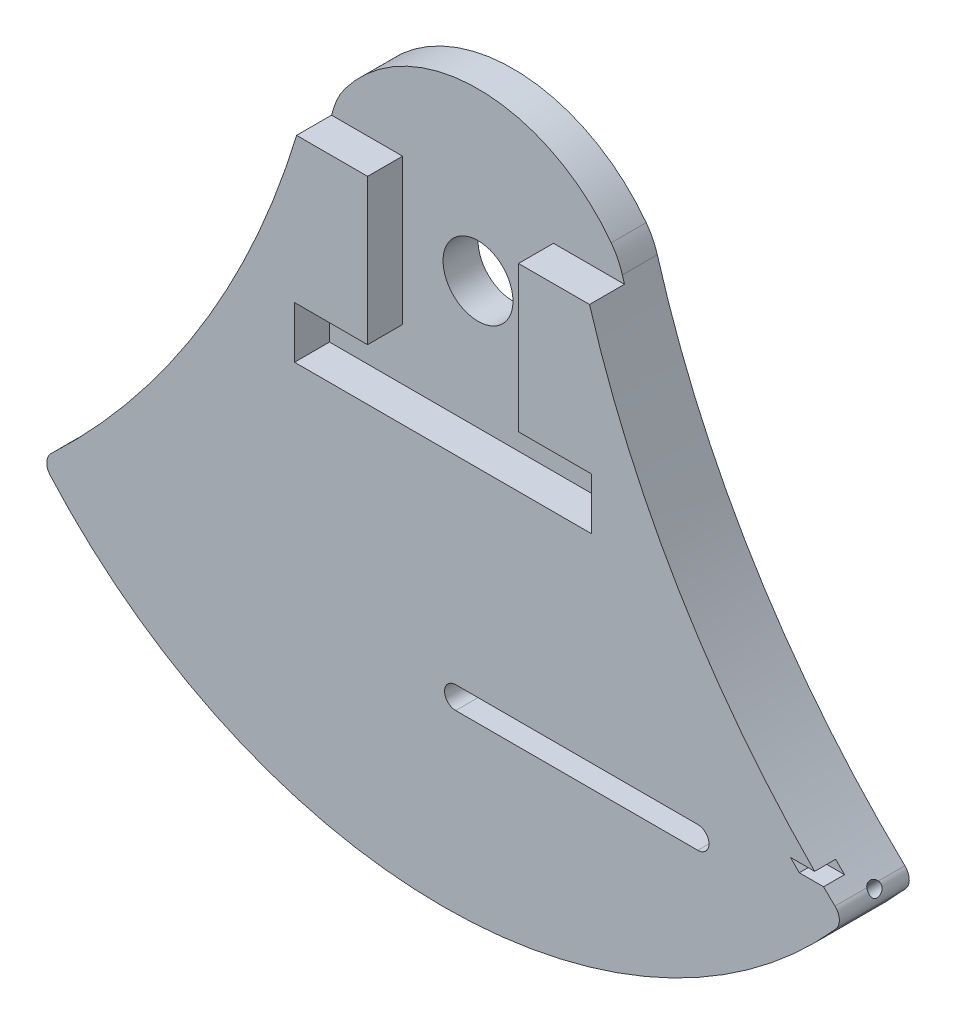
ISO-10303-21;
HEADER;
FILE_DESCRIPTION(('STEP AP214'),'2;1');
FILE_NAME('part.step','',(''),(''),'','','');
FILE_SCHEMA(('AUTOMOTIVE_DESIGN { 1 0 10303 214 1 1 1 1 }'));
ENDSEC;
DATA;
#1=APPLICATION_CONTEXT('core data for automotive mechanical design processes');
#2=APPLICATION_PROTOCOL_DEFINITION('international standard','automotive_design',2000,#1);
#3=PRODUCT_CONTEXT('',#1,'mechanical');
#4=PRODUCT('Part','Part','',(#3));
#5=PRODUCT_RELATED_PRODUCT_CATEGORY('part','',(#4));
#6=PRODUCT_DEFINITION_FORMATION('','',#4);
#7=PRODUCT_DEFINITION_CONTEXT('part definition',#1,'design');
#8=PRODUCT_DEFINITION('design','',#6,#7);
#9=PRODUCT_DEFINITION_SHAPE('','',#8);
#10=(LENGTH_UNIT() NAMED_UNIT(*) SI_UNIT(.MILLI.,.METRE.));
#11=(NAMED_UNIT(*) PLANE_ANGLE_UNIT() SI_UNIT($,.RADIAN.));
#12=(NAMED_UNIT(*) SI_UNIT($,.STERADIAN.) SOLID_ANGLE_UNIT());
#13=UNCERTAINTY_MEASURE_WITH_UNIT(LENGTH_MEASURE(1.E-05),#10,'distance_accuracy_value','');
#14=(GEOMETRIC_REPRESENTATION_CONTEXT(3) GLOBAL_UNCERTAINTY_ASSIGNED_CONTEXT((#13)) GLOBAL_UNIT_ASSIGNED_CONTEXT((#10,
#11,#12)) REPRESENTATION_CONTEXT('',''));
#15=CARTESIAN_POINT('',(0.,0.,0.));
#16=DIRECTION('',(0.,0.,1.));
#17=DIRECTION('',(1.,0.,0.));
#18=AXIS2_PLACEMENT_3D('',#15,#16,#17);
#19=CARTESIAN_POINT('',(-145.699843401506,47.6415158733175,10.));
#20=DIRECTION('',(0.,0.,-1.));
#21=DIRECTION('',(-1.,0.,0.));
#22=AXIS2_PLACEMENT_3D('',#19,#20,#21);
#23=CYLINDRICAL_SURFACE('',#22,130.287303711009);
#24=CARTESIAN_POINT('',(-145.699843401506,47.6415158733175,5.));
#25=DIRECTION('',(0.,0.,1.));
#26=DIRECTION('',(1.,0.,0.));
#27=AXIS2_PLACEMENT_3D('',#24,#25,#26);
#28=CIRCLE('',#27,130.287303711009);
#29=CARTESIAN_POINT('',(-20.6506000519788,11.0701029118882,5.));
#30=VERTEX_POINT('',#29);
#31=CARTESIAN_POINT('',(-20.9503610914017,10.0602948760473,5.));
#32=VERTEX_POINT('',#31);
#33=EDGE_CURVE('E905',#30,#32,#28,.F.);
#34=ORIENTED_EDGE('',*,*,#33,.F.);
#35=DIRECTION('',(0.,0.,-1.));
#36=VECTOR('',#35,1.);
#37=CARTESIAN_POINT('',(-20.6506000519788,11.0701029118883,10.));
#38=LINE('',#37,#36);
#39=CARTESIAN_POINT('',(-20.6506000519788,11.0701029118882,0.));
#40=VERTEX_POINT('',#39);
#41=EDGE_CURVE('E62',#30,#40,#38,.T.);
#42=ORIENTED_EDGE('',*,*,#41,.T.);
#43=CARTESIAN_POINT('',(-145.699843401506,47.6415158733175,0.));
#44=DIRECTION('',(0.,0.,-1.));
#45=DIRECTION('',(1.,0.,0.));
#46=AXIS2_PLACEMENT_3D('',#43,#44,#45);
#47=CIRCLE('',#46,130.287303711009);
#48=CARTESIAN_POINT('',(-56.0604909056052,-46.9077728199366,0.));
#49=VERTEX_POINT('',#48);
#50=EDGE_CURVE('E297',#40,#49,#47,.T.);
#51=ORIENTED_EDGE('',*,*,#50,.T.);
#52=DIRECTION('',(0.,0.,-1.));
#53=VECTOR('',#52,1.);
#54=CARTESIAN_POINT('',(-56.0604909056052,-46.9077728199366,10.));
#55=LINE('',#54,#53);
#56=CARTESIAN_POINT('',(-56.0604909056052,-46.9077728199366,10.));
#57=VERTEX_POINT('',#56);
#58=EDGE_CURVE('E275',#49,#57,#55,.F.);
#59=ORIENTED_EDGE('',*,*,#58,.T.);
#60=CARTESIAN_POINT('',(-145.699843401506,47.6415158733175,10.));
#61=DIRECTION('',(0.,0.,-1.));
#62=DIRECTION('',(1.,0.,0.));
#63=AXIS2_PLACEMENT_3D('',#60,#61,#62);
#64=CIRCLE('',#63,130.287303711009);
#65=CARTESIAN_POINT('',(-20.9503610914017,10.0602948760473,10.));
#66=VERTEX_POINT('',#65);
#67=EDGE_CURVE('E306',#66,#57,#64,.T.);
#68=ORIENTED_EDGE('',*,*,#67,.F.);
#69=DIRECTION('',(0.,0.,-1.));
#70=VECTOR('',#69,1.);
#71=CARTESIAN_POINT('',(-20.9503610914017,10.0602948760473,10.));
#72=LINE('',#71,#70);
#73=EDGE_CURVE('E910',#66,#32,#72,.T.);
#74=ORIENTED_EDGE('',*,*,#73,.T.);
#75=EDGE_LOOP('',(#34,#42,#51,#59,#68,#74));
#76=FACE_BOUND('',#75,.T.);
#77=CARTESIAN_POINT('',(-54.9219988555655,-45.8152358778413,5.3768108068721));
#78=CARTESIAN_POINT('',(-54.9220004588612,-45.8152374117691,5.4498390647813));
#79=CARTESIAN_POINT('',(-54.917040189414,-45.8104201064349,5.52285860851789));
#80=CARTESIAN_POINT('',(-54.8976295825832,-45.7915599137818,5.66639069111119));
#81=CARTESIAN_POINT('',(-54.8831758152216,-45.7775136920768,5.73690231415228));
#82=CARTESIAN_POINT('',(-54.8459960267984,-45.7413550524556,5.87298051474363));
#83=CARTESIAN_POINT('',(-54.823320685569,-45.7192920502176,5.93857447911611));
#84=CARTESIAN_POINT('',(-54.7710705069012,-45.6684037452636,6.06410236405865));
#85=CARTESIAN_POINT('',(-54.7414921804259,-45.6395750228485,6.12403340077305));
#86=CARTESIAN_POINT('',(-54.6641138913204,-45.5640707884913,6.25992943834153));
#87=CARTESIAN_POINT('',(-54.6137137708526,-45.5148269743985,6.33298549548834));
#88=CARTESIAN_POINT('',(-54.5052792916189,-45.4086790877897,6.46682735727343));
#89=CARTESIAN_POINT('',(-54.4472295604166,-45.3517595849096,6.52758781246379));
#90=CARTESIAN_POINT('',(-54.3030579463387,-45.2101008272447,6.65787599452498));
#91=CARTESIAN_POINT('',(-54.214574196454,-45.1229353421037,6.72214237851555));
#92=CARTESIAN_POINT('',(-54.0317928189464,-44.9423198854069,6.83008169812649));
#93=CARTESIAN_POINT('',(-53.9374873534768,-44.848861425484,6.8737261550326));
#94=CARTESIAN_POINT('',(-53.7196130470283,-44.6322518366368,6.95122757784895));
#95=CARTESIAN_POINT('',(-53.5950753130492,-44.5079518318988,6.97917262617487));
#96=CARTESIAN_POINT('',(-53.3449229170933,-44.2572419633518,7.00597861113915));
#97=CARTESIAN_POINT('',(-53.2193070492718,-44.1308295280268,7.00480105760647));
#98=CARTESIAN_POINT('',(-52.9692650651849,-43.878170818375,6.97343384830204));
#99=CARTESIAN_POINT('',(-52.844856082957,-43.751933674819,6.94301602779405));
#100=CARTESIAN_POINT('',(-52.6630639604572,-43.566744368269,6.87445269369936));
#101=CARTESIAN_POINT('',(-52.6032950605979,-43.5057345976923,6.84779203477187));
#102=CARTESIAN_POINT('',(-52.485927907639,-43.3857025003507,6.78648106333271));
#103=CARTESIAN_POINT('',(-52.4283283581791,-43.3266789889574,6.75183561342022));
#104=CARTESIAN_POINT('',(-52.3028465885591,-43.1978607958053,6.66498921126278));
#105=CARTESIAN_POINT('',(-52.2357247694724,-43.128790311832,6.61057632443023));
#106=CARTESIAN_POINT('',(-52.1080113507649,-42.9971009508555,6.48800218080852));
#107=CARTESIAN_POINT('',(-52.0474099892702,-42.9344724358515,6.41986192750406));
#108=CARTESIAN_POINT('',(-51.9488191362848,-42.8324072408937,6.28685625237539));
#109=CARTESIAN_POINT('',(-51.9088639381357,-42.7909805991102,6.22499100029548));
#110=CARTESIAN_POINT('',(-51.8363280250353,-42.7156903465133,6.09285753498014));
#111=CARTESIAN_POINT('',(-51.8037374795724,-42.6818166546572,6.0226007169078));
#112=CARTESIAN_POINT('',(-51.7533300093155,-42.6293831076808,5.88850752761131));
#113=CARTESIAN_POINT('',(-51.7338876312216,-42.6091415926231,5.82594641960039));
#114=CARTESIAN_POINT('',(-51.7024811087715,-42.5764308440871,5.69701211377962));
#115=CARTESIAN_POINT('',(-51.6905115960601,-42.5639560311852,5.63064169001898));
#116=CARTESIAN_POINT('',(-51.674910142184,-42.5476939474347,5.49553495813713));
#117=CARTESIAN_POINT('',(-51.671317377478,-42.5439474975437,5.42678905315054));
#118=CARTESIAN_POINT('',(-51.6728946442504,-42.5455919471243,5.28951000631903));
#119=CARTESIAN_POINT('',(-51.6780642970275,-42.5509824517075,5.22097685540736));
#120=CARTESIAN_POINT('',(-51.696040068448,-42.5697174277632,5.0912717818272));
#121=CARTESIAN_POINT('',(-51.7082629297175,-42.5824543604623,5.02992715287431));
#122=CARTESIAN_POINT('',(-51.739067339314,-42.6145341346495,4.91068522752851));
#123=CARTESIAN_POINT('',(-51.7576513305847,-42.6338795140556,4.85278926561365));
#124=CARTESIAN_POINT('',(-51.8079599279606,-42.6862066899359,4.72106886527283));
#125=CARTESIAN_POINT('',(-51.8420058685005,-42.7215894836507,4.649084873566));
#126=CARTESIAN_POINT('',(-51.9177808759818,-42.800229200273,4.51401849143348));
#127=CARTESIAN_POINT('',(-51.9595250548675,-42.8435016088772,4.45095404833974));
#128=CARTESIAN_POINT('',(-52.0659751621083,-42.9536721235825,4.31115308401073));
#129=CARTESIAN_POINT('',(-52.1333223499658,-43.023239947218,4.23854402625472));
#130=CARTESIAN_POINT('',(-52.2752874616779,-43.1695205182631,4.10954650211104));
#131=CARTESIAN_POINT('',(-52.3499177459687,-43.2462454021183,4.05318627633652));
#132=CARTESIAN_POINT('',(-52.5323641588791,-43.4333159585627,3.93752788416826));
#133=CARTESIAN_POINT('',(-52.6422905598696,-43.5456485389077,3.8847729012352));
#134=CARTESIAN_POINT('',(-52.8670302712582,-43.7744354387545,3.8051946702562));
#135=CARTESIAN_POINT('',(-52.9818484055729,-43.8908938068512,3.77839766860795));
#136=CARTESIAN_POINT('',(-53.2155815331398,-44.1270566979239,3.7495087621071));
#137=CARTESIAN_POINT('',(-53.33453303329,-44.2467815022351,3.74788099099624));
#138=CARTESIAN_POINT('',(-53.5716445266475,-44.4845097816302,3.77076863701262));
#139=CARTESIAN_POINT('',(-53.6898049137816,-44.6025141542,3.7952698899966));
#140=CARTESIAN_POINT('',(-53.9021190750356,-44.8137587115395,3.86528188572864));
#141=CARTESIAN_POINT('',(-53.9969188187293,-44.9077791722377,3.90647634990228));
#142=CARTESIAN_POINT('',(-54.1810727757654,-45.089885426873,4.00928278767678));
#143=CARTESIAN_POINT('',(-54.2704346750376,-45.1779796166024,4.07086511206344));
#144=CARTESIAN_POINT('',(-54.4161451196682,-45.3212472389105,4.1958769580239));
#145=CARTESIAN_POINT('',(-54.4747498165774,-45.3787496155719,4.25400058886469));
#146=CARTESIAN_POINT('',(-54.5849162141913,-45.4866617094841,4.38231618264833));
#147=CARTESIAN_POINT('',(-54.6364881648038,-45.5370817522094,4.45249023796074));
#148=CARTESIAN_POINT('',(-54.719608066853,-45.6182338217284,4.58833064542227));
#149=CARTESIAN_POINT('',(-54.7530735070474,-45.6508646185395,4.65167907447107));
#150=CARTESIAN_POINT('',(-54.8122244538,-45.7084918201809,4.78517572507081));
#151=CARTESIAN_POINT('',(-54.8379151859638,-45.7334933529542,4.85531933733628));
#152=CARTESIAN_POINT('',(-54.8792839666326,-45.7737308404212,4.99934951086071));
#153=CARTESIAN_POINT('',(-54.8951781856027,-45.789177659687,5.0731132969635));
#154=CARTESIAN_POINT('',(-54.9165310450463,-45.8099257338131,5.22352626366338));
#155=CARTESIAN_POINT('',(-54.9219971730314,-45.8152342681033,5.30017333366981));
#156=CARTESIAN_POINT('',(-54.9219988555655,-45.8152358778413,5.3768108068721));
#157=B_SPLINE_CURVE_WITH_KNOTS('',3,(#77,#78,#79,#80,#81,#82,#83,#84,#85,#86,#87,#88,#89,#90,
#91,#92,#93,#94,#95,#96,#97,#98,#99,#100,#101,#102,#103,#104,#105,#106,#107,#108,#109,#110,#111,
#112,#113,#114,#115,#116,#117,#118,#119,#120,#121,#122,#123,#124,#125,#126,#127,#128,#129,#130,
#131,#132,#133,#134,#135,#136,#137,#138,#139,#140,#141,#142,#143,#144,#145,#146,#147,#148,#149,
#150,#151,#152,#153,#154,#155,#156),.UNSPECIFIED.,.T.,.F.,(4,2,2,2,2,2,2,2,2,2,2,2,2,2,2,2,2,2,
2,2,2,2,2,2,2,2,2,2,2,2,2,2,2,2,2,2,2,2,2,4),(0.,0.218758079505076,0.437595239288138,
0.655105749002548,0.872726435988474,1.17554897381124,1.47898960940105,1.89625865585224,
2.31410227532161,2.84585746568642,3.37831549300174,3.91496235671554,4.18305299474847,
4.4509807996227,4.7818060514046,5.11212891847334,5.36474886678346,5.61702959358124,
5.82189226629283,6.02660759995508,6.23227844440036,6.43794040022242,6.62863202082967,
6.81939695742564,7.07936270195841,7.33984430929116,7.70093529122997,8.06265012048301,
8.55739920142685,9.05264800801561,9.55701879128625,10.061116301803,10.4788894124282,
10.8960576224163,11.1968717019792,11.4972425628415,11.7325294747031,11.9676578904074,
12.1973924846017,12.4269620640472),.UNSPECIFIED.);
#158=CARTESIAN_POINT('',(-54.9219988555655,-45.8152358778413,5.3768108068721));
#159=VERTEX_POINT('',#158);
#160=EDGE_CURVE('E53',#159,#159,#157,.T.);
#161=ORIENTED_EDGE('',*,*,#160,.F.);
#162=EDGE_LOOP('',(#161));
#163=FACE_BOUND('',#162,.T.);
#164=ADVANCED_FACE('F49',(#76,#163),#23,.F.);
#165=CARTESIAN_POINT('',(0.,0.,0.));
#166=DIRECTION('',(0.,0.,1.));
#167=DIRECTION('',(1.,0.,0.));
#168=AXIS2_PLACEMENT_3D('',#165,#166,#167);
#169=CYLINDRICAL_SURFACE('',#168,5.);
#170=CARTESIAN_POINT('',(0.,0.,0.));
#171=DIRECTION('',(0.,0.,1.));
#172=DIRECTION('',(1.,0.,0.));
#173=AXIS2_PLACEMENT_3D('',#170,#171,#172);
#174=CIRCLE('',#173,5.);
#175=CARTESIAN_POINT('',(5.,0.,0.));
#176=VERTEX_POINT('',#175);
#177=EDGE_CURVE('E301',#176,#176,#174,.T.);
#178=ORIENTED_EDGE('',*,*,#177,.F.);
#179=EDGE_LOOP('',(#178));
#180=FACE_BOUND('',#179,.T.);
#181=CARTESIAN_POINT('',(0.,0.,5.));
#182=DIRECTION('',(0.,0.,1.));
#183=DIRECTION('',(1.,0.,0.));
#184=AXIS2_PLACEMENT_3D('',#181,#182,#183);
#185=CIRCLE('',#184,5.);
#186=CARTESIAN_POINT('',(5.,0.,5.));
#187=VERTEX_POINT('',#186);
#188=EDGE_CURVE('E907',#187,#187,#185,.F.);
#189=ORIENTED_EDGE('',*,*,#188,.F.);
#190=EDGE_LOOP('',(#189));
#191=FACE_BOUND('',#190,.T.);
#192=ADVANCED_FACE('F487',(#180,#191),#169,.F.);
#193=CARTESIAN_POINT('',(0.,0.,0.));
#194=DIRECTION('',(0.,0.,1.));
#195=DIRECTION('',(1.,0.,0.));
#196=AXIS2_PLACEMENT_3D('',#193,#194,#195);
#197=CYLINDRICAL_SURFACE('',#196,23.8);
#198=CARTESIAN_POINT('',(0.,0.,5.));
#199=DIRECTION('',(0.,0.,1.));
#200=DIRECTION('',(1.,0.,0.));
#201=AXIS2_PLACEMENT_3D('',#198,#199,#200);
#202=CIRCLE('',#201,23.8);
#203=CARTESIAN_POINT('',(19.0617981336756,14.2508895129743,5.));
#204=VERTEX_POINT('',#203);
#205=CARTESIAN_POINT('',(-19.061798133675,14.2508895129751,5.));
#206=VERTEX_POINT('',#205);
#207=EDGE_CURVE('E948',#204,#206,#202,.T.);
#208=ORIENTED_EDGE('',*,*,#207,.F.);
#209=DIRECTION('',(0.,0.,1.));
#210=VECTOR('',#209,1.);
#211=CARTESIAN_POINT('',(19.0617981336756,14.2508895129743,0.));
#212=LINE('',#211,#210);
#213=CARTESIAN_POINT('',(19.0617981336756,14.2508895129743,0.));
#214=VERTEX_POINT('',#213);
#215=EDGE_CURVE('E991',#204,#214,#212,.F.);
#216=ORIENTED_EDGE('',*,*,#215,.T.);
#217=CARTESIAN_POINT('',(0.,0.,0.));
#218=DIRECTION('',(0.,0.,-1.));
#219=DIRECTION('',(-1.,0.,0.));
#220=AXIS2_PLACEMENT_3D('',#217,#218,#219);
#221=CIRCLE('',#220,23.8);
#222=CARTESIAN_POINT('',(-19.061798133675,14.2508895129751,0.));
#223=VERTEX_POINT('',#222);
#224=EDGE_CURVE('E915',#223,#214,#221,.T.);
#225=ORIENTED_EDGE('',*,*,#224,.F.);
#226=DIRECTION('',(0.,0.,1.));
#227=VECTOR('',#226,1.);
#228=CARTESIAN_POINT('',(-19.061798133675,14.2508895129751,0.));
#229=LINE('',#228,#227);
#230=EDGE_CURVE('E995',#223,#206,#229,.T.);
#231=ORIENTED_EDGE('',*,*,#230,.T.);
#232=EDGE_LOOP('',(#208,#216,#225,#231));
#233=FACE_BOUND('',#232,.T.);
#234=ADVANCED_FACE('F437',(#233),#197,.T.);
#235=CARTESIAN_POINT('',(0.,0.,10.));
#236=DIRECTION('',(0.,0.,-1.));
#237=DIRECTION('',(-1.,0.,0.));
#238=AXIS2_PLACEMENT_3D('',#235,#236,#237);
#239=CYLINDRICAL_SURFACE('',#238,75.);
#240=CARTESIAN_POINT('',(-52.3931888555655,-53.6652006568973,5.37681));
#241=CARTESIAN_POINT('',(-52.393187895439,-53.6652015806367,5.3362499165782));
#242=CARTESIAN_POINT('',(-52.3959390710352,-53.6625160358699,5.29569503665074));
#243=CARTESIAN_POINT('',(-52.4067036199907,-53.6520034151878,5.21598022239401));
#244=CARTESIAN_POINT('',(-52.4147189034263,-53.6441744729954,5.17682079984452));
#245=CARTESIAN_POINT('',(-52.4353332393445,-53.624024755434,5.10125325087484));
#246=CARTESIAN_POINT('',(-52.4479039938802,-53.6117317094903,5.06482977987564));
#247=CARTESIAN_POINT('',(-52.4768660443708,-53.5833830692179,4.99512672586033));
#248=CARTESIAN_POINT('',(-52.4932592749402,-53.5673255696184,4.9618487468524));
#249=CARTESIAN_POINT('',(-52.5361837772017,-53.5252333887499,4.88630846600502));
#250=CARTESIAN_POINT('',(-52.5641646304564,-53.4977603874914,4.84567220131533));
#251=CARTESIAN_POINT('',(-52.6243619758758,-53.4385471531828,4.77122396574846));
#252=CARTESIAN_POINT('',(-52.6565870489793,-53.4067982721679,4.73742618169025));
#253=CARTESIAN_POINT('',(-52.7367148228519,-53.3276958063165,4.66485556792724));
#254=CARTESIAN_POINT('',(-52.785938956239,-53.2789803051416,4.62903195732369));
#255=CARTESIAN_POINT('',(-52.8876234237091,-53.1780448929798,4.56886027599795));
#256=CARTESIAN_POINT('',(-52.9400881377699,-53.1258202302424,4.54452813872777));
#257=CARTESIAN_POINT('',(-53.0613991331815,-53.0046895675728,4.5012677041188));
#258=CARTESIAN_POINT('',(-53.1307885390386,-52.9351400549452,4.48565677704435));
#259=CARTESIAN_POINT('',(-53.2701940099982,-52.7948505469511,4.47067770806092));
#260=CARTESIAN_POINT('',(-53.3402107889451,-52.7241090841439,4.47133131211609));
#261=CARTESIAN_POINT('',(-53.4795297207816,-52.5827902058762,4.48881980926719));
#262=CARTESIAN_POINT('',(-53.5488217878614,-52.5122185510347,4.50578311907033));
#263=CARTESIAN_POINT('',(-53.683952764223,-52.3740630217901,4.55684479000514));
#264=CARTESIAN_POINT('',(-53.7497994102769,-52.3064725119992,4.59090276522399));
#265=CARTESIAN_POINT('',(-53.8508129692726,-52.2024235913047,4.66102386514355));
#266=CARTESIAN_POINT('',(-53.8880270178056,-52.1640025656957,4.69126050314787));
#267=CARTESIAN_POINT('',(-53.9588521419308,-52.0907366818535,4.75937133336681));
#268=CARTESIAN_POINT('',(-53.9924685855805,-52.0558864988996,4.79723389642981));
#269=CARTESIAN_POINT('',(-54.0471738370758,-51.9990786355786,4.87114360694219));
#270=CARTESIAN_POINT('',(-54.0693506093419,-51.9760153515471,4.90552855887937));
#271=CARTESIAN_POINT('',(-54.109613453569,-51.9340983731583,4.97897019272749));
#272=CARTESIAN_POINT('',(-54.1277049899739,-51.9152390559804,5.01802052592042));
#273=CARTESIAN_POINT('',(-54.1556774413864,-51.8860572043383,5.09253039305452));
#274=CARTESIAN_POINT('',(-54.1664632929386,-51.8747955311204,5.12727870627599));
#275=CARTESIAN_POINT('',(-54.1838881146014,-51.8565948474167,5.1988933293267));
#276=CARTESIAN_POINT('',(-54.1905300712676,-51.8496527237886,5.23575809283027));
#277=CARTESIAN_POINT('',(-54.1991894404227,-51.8406009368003,5.31080321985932));
#278=CARTESIAN_POINT('',(-54.2011850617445,-51.8385140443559,5.34898893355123));
#279=CARTESIAN_POINT('',(-54.200315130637,-51.8394236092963,5.42524282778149));
#280=CARTESIAN_POINT('',(-54.1974497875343,-51.8424198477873,5.46331101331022));
#281=CARTESIAN_POINT('',(-54.1874836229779,-51.852836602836,5.5353530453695));
#282=CARTESIAN_POINT('',(-54.1807069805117,-51.85991847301,5.56942300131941));
#283=CARTESIAN_POINT('',(-54.1636281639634,-51.8777556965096,5.63564902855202));
#284=CARTESIAN_POINT('',(-54.1533246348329,-51.8885124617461,5.66780435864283));
#285=CARTESIAN_POINT('',(-54.1254225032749,-51.9176191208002,5.74099037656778));
#286=CARTESIAN_POINT('',(-54.106533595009,-51.937307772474,5.78099667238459));
#287=CARTESIAN_POINT('',(-54.064493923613,-51.9810679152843,5.85606380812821));
#288=CARTESIAN_POINT('',(-54.0413347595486,-52.0051480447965,5.89111465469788));
#289=CARTESIAN_POINT('',(-53.9822417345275,-52.0664960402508,5.96887160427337));
#290=CARTESIAN_POINT('',(-53.9448367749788,-52.1052566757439,6.00927497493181));
#291=CARTESIAN_POINT('',(-53.8659922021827,-52.1867619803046,6.08106180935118));
#292=CARTESIAN_POINT('',(-53.8245457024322,-52.229513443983,6.1124295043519));
#293=CARTESIAN_POINT('',(-53.7231114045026,-52.3338737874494,6.17689151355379));
#294=CARTESIAN_POINT('',(-53.6619437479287,-52.3966004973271,6.20631912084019));
#295=CARTESIAN_POINT('',(-53.5368950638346,-52.5243647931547,6.25072605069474));
#296=CARTESIAN_POINT('',(-53.4730113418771,-52.5894046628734,6.26569065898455));
#297=CARTESIAN_POINT('',(-53.3429483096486,-52.7213296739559,6.28187036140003));
#298=CARTESIAN_POINT('',(-53.2767484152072,-52.7882265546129,6.2828225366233));
#299=CARTESIAN_POINT('',(-53.1447887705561,-52.9210749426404,6.27017164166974));
#300=CARTESIAN_POINT('',(-53.0790288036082,-52.987026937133,6.25657636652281));
#301=CARTESIAN_POINT('',(-52.9608297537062,-53.1051435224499,6.21766987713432));
#302=CARTESIAN_POINT('',(-52.9080333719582,-53.1577394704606,6.1947554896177));
#303=CARTESIAN_POINT('',(-52.8054652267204,-53.2596285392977,6.13753844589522));
#304=CARTESIAN_POINT('',(-52.7556891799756,-53.3089263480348,6.10325238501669));
#305=CARTESIAN_POINT('',(-52.6745994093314,-53.3890332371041,6.03368817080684));
#306=CARTESIAN_POINT('',(-52.6420245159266,-53.4211485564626,6.00138832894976));
#307=CARTESIAN_POINT('',(-52.5807759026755,-53.4814345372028,5.93007209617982));
#308=CARTESIAN_POINT('',(-52.5520964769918,-53.5096109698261,5.8910657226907));
#309=CARTESIAN_POINT('',(-52.5058887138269,-53.5549480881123,5.81558766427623));
#310=CARTESIAN_POINT('',(-52.4872921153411,-53.5731714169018,5.78041409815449));
#311=CARTESIAN_POINT('',(-52.4544060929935,-53.6053711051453,5.70627917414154));
#312=CARTESIAN_POINT('',(-52.4401138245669,-53.6193502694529,5.66732034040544));
#313=CARTESIAN_POINT('',(-52.4170494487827,-53.6418976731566,5.58719586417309));
#314=CARTESIAN_POINT('',(-52.4081716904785,-53.6505694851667,5.54609067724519));
#315=CARTESIAN_POINT('',(-52.3962440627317,-53.6622183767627,5.46225758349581));
#316=CARTESIAN_POINT('',(-52.3931898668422,-53.665199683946,5.41953090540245));
#317=CARTESIAN_POINT('',(-52.3931888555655,-53.6652006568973,5.37681));
#318=B_SPLINE_CURVE_WITH_KNOTS('',3,(#240,#241,#242,#243,#244,#245,#246,#247,#248,#249,#250,
#251,#252,#253,#254,#255,#256,#257,#258,#259,#260,#261,#262,#263,#264,#265,#266,#267,#268,#269,
#270,#271,#272,#273,#274,#275,#276,#277,#278,#279,#280,#281,#282,#283,#284,#285,#286,#287,#288,
#289,#290,#291,#292,#293,#294,#295,#296,#297,#298,#299,#300,#301,#302,#303,#304,#305,#306,#307,
#308,#309,#310,#311,#312,#313,#314,#315,#316,#317),.UNSPECIFIED.,.T.,.F.,(4,2,2,2,2,2,2,2,2,2,2,
2,2,2,2,2,2,2,2,2,2,2,2,2,2,2,2,2,2,2,2,2,2,2,2,2,2,2,4),(0.,0.121497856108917,
0.243039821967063,0.363839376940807,0.484700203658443,0.653179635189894,0.822005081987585,
1.0546516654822,1.28761988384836,1.58454512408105,1.88186737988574,2.18154997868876,
2.48052789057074,2.66433301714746,2.84785994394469,2.98828264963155,3.12851639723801,
3.2423092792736,3.35602005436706,3.47026306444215,3.58450115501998,3.6904067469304,
3.79635307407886,3.94082424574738,4.08558273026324,4.28647992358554,4.48772562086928,
4.76353816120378,5.03963101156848,5.32089779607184,5.60201394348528,5.83513032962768,
6.06790800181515,6.23536399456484,6.40257200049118,6.53336401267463,6.66406939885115,
6.79213518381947,6.92010578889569),.UNSPECIFIED.);
#319=CARTESIAN_POINT('',(-52.3931888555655,-53.6652006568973,5.37681));
#320=VERTEX_POINT('',#319);
#321=EDGE_CURVE('E532',#320,#320,#318,.T.);
#322=ORIENTED_EDGE('',*,*,#321,.T.);
#323=EDGE_LOOP('',(#322));
#324=FACE_BOUND('',#323,.T.);
#325=DIRECTION('',(0.,0.,-1.));
#326=VECTOR('',#325,1.);
#327=CARTESIAN_POINT('',(-47.5153733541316,-58.0283490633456,8.27476320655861));
#328=LINE('',#327,#326);
#329=CARTESIAN_POINT('',(-47.5153733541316,-58.0283490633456,8.27476320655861));
#330=VERTEX_POINT('',#329);
#331=CARTESIAN_POINT('',(-47.5153733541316,-58.0283490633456,1.86415555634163));
#332=VERTEX_POINT('',#331);
#333=EDGE_CURVE('E346',#330,#332,#328,.T.);
#334=ORIENTED_EDGE('',*,*,#333,.F.);
#335=CARTESIAN_POINT('',(0.,0.,8.27476320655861));
#336=DIRECTION('',(0.,0.,-1.));
#337=DIRECTION('',(-0.633538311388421,-0.773711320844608,0.));
#338=AXIS2_PLACEMENT_3D('',#335,#336,#337);
#339=CIRCLE('',#338,75.);
#340=CARTESIAN_POINT('',(53.5116440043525,-52.550013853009,8.27476320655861));
#341=VERTEX_POINT('',#340);
#342=EDGE_CURVE('E351',#341,#330,#339,.T.);
#343=ORIENTED_EDGE('',*,*,#342,.F.);
#344=DIRECTION('',(0.,0.,1.));
#345=VECTOR('',#344,1.);
#346=CARTESIAN_POINT('',(53.5116440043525,-52.550013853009,1.86415555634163));
#347=LINE('',#346,#345);
#348=CARTESIAN_POINT('',(53.5116440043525,-52.550013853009,1.86415555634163));
#349=VERTEX_POINT('',#348);
#350=EDGE_CURVE('E354',#349,#341,#347,.T.);
#351=ORIENTED_EDGE('',*,*,#350,.F.);
#352=CARTESIAN_POINT('',(0.,0.,1.86415555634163));
#353=DIRECTION('',(0.,0.,-1.));
#354=DIRECTION('',(-0.633538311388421,-0.773711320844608,0.));
#355=AXIS2_PLACEMENT_3D('',#352,#353,#354);
#356=CIRCLE('',#355,75.);
#357=EDGE_CURVE('E342',#349,#332,#356,.T.);
#358=ORIENTED_EDGE('',*,*,#357,.T.);
#359=EDGE_LOOP('',(#334,#343,#351,#358));
#360=FACE_BOUND('',#359,.T.);
#361=CARTESIAN_POINT('',(0.,0.,0.));
#362=DIRECTION('',(0.,0.,1.));
#363=DIRECTION('',(-1.,0.,0.));
#364=AXIS2_PLACEMENT_3D('',#361,#362,#363);
#365=CIRCLE('',#364,75.);
#366=CARTESIAN_POINT('',(-56.1826695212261,-49.6840783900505,0.));
#367=VERTEX_POINT('',#366);
#368=CARTESIAN_POINT('',(56.1826695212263,-49.6840783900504,0.));
#369=VERTEX_POINT('',#368);
#370=EDGE_CURVE('E300',#367,#369,#365,.T.);
#371=ORIENTED_EDGE('',*,*,#370,.T.);
#372=DIRECTION('',(0.,0.,-1.));
#373=VECTOR('',#372,1.);
#374=CARTESIAN_POINT('',(56.1826695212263,-49.6840783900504,10.));
#375=LINE('',#374,#373);
#376=CARTESIAN_POINT('',(56.1826695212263,-49.6840783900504,10.));
#377=VERTEX_POINT('',#376);
#378=EDGE_CURVE('E280',#369,#377,#375,.F.);
#379=ORIENTED_EDGE('',*,*,#378,.T.);
#380=CARTESIAN_POINT('',(0.,0.,10.));
#381=DIRECTION('',(0.,0.,1.));
#382=DIRECTION('',(-1.,0.,0.));
#383=AXIS2_PLACEMENT_3D('',#380,#381,#382);
#384=CIRCLE('',#383,75.);
#385=CARTESIAN_POINT('',(-56.1826695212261,-49.6840783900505,10.));
#386=VERTEX_POINT('',#385);
#387=EDGE_CURVE('E295',#386,#377,#384,.T.);
#388=ORIENTED_EDGE('',*,*,#387,.F.);
#389=DIRECTION('',(0.,0.,-1.));
#390=VECTOR('',#389,1.);
#391=CARTESIAN_POINT('',(-56.1826695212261,-49.6840783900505,10.));
#392=LINE('',#391,#390);
#393=EDGE_CURVE('E289',#386,#367,#392,.T.);
#394=ORIENTED_EDGE('',*,*,#393,.T.);
#395=EDGE_LOOP('',(#371,#379,#388,#394));
#396=FACE_BOUND('',#395,.T.);
#397=ADVANCED_FACE('F328',(#324,#360,#396),#239,.T.);
#398=CARTESIAN_POINT('',(145.699843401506,47.6415158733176,10.));
#399=DIRECTION('',(0.,0.,-1.));
#400=DIRECTION('',(-1.,0.,0.));
#401=AXIS2_PLACEMENT_3D('',#398,#399,#400);
#402=CYLINDRICAL_SURFACE('',#401,130.287303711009);
#403=DIRECTION('',(0.,0.,-1.));
#404=VECTOR('',#403,1.);
#405=CARTESIAN_POINT('',(56.0604909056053,-46.9077728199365,10.));
#406=LINE('',#405,#404);
#407=CARTESIAN_POINT('',(56.0604909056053,-46.9077728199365,10.));
#408=VERTEX_POINT('',#407);
#409=CARTESIAN_POINT('',(56.0604909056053,-46.9077728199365,5.45137763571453));
#410=VERTEX_POINT('',#409);
#411=EDGE_CURVE('E265',#408,#410,#406,.T.);
#412=ORIENTED_EDGE('',*,*,#411,.T.);
#413=CARTESIAN_POINT('',(56.0604909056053,-46.9077728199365,5.45137763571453));
#414=CARTESIAN_POINT('',(56.0265089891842,-46.8755561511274,5.42561418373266));
#415=CARTESIAN_POINT('',(55.9941644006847,-46.8448558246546,5.3958309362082));
#416=CARTESIAN_POINT('',(55.9335882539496,-46.7873073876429,5.32925230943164));
#417=CARTESIAN_POINT('',(55.9053536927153,-46.7604564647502,5.29246209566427));
#418=CARTESIAN_POINT('',(55.8537715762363,-46.71136519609,5.21283753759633));
#419=CARTESIAN_POINT('',(55.8304263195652,-46.6891270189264,5.17000036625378));
#420=CARTESIAN_POINT('',(55.7892891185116,-46.6499182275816,5.07953132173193));
#421=CARTESIAN_POINT('',(55.7714960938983,-46.6329465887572,5.03190038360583));
#422=CARTESIAN_POINT('',(55.7419556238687,-46.604759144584,4.93318852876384));
#423=CARTESIAN_POINT('',(55.7302078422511,-46.593543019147,4.88210780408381));
#424=CARTESIAN_POINT('',(55.7130815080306,-46.5771889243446,4.77793663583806));
#425=CARTESIAN_POINT('',(55.7077039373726,-46.5720518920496,4.72484588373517));
#426=CARTESIAN_POINT('',(55.7034711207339,-46.5680085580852,4.61817303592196));
#427=CARTESIAN_POINT('',(55.7046154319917,-46.5691018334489,4.56459097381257));
#428=CARTESIAN_POINT('',(55.7133931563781,-46.5774860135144,4.45845897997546));
#429=CARTESIAN_POINT('',(55.7210258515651,-46.5847762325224,4.4059089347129));
#430=CARTESIAN_POINT('',(55.7425653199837,-46.6053400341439,4.30333279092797));
#431=CARTESIAN_POINT('',(55.7564713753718,-46.6186129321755,4.25330640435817));
#432=CARTESIAN_POINT('',(55.7901779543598,-46.6507643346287,4.15717315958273));
#433=CARTESIAN_POINT('',(55.809980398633,-46.6696446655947,4.11106758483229));
#434=CARTESIAN_POINT('',(55.8549316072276,-46.7124681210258,4.02408317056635));
#435=CARTESIAN_POINT('',(55.8800836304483,-46.7364143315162,3.983207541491));
#436=CARTESIAN_POINT('',(55.9350114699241,-46.7886587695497,3.9079092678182));
#437=CARTESIAN_POINT('',(55.9647803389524,-46.8169504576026,3.87347709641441));
#438=CARTESIAN_POINT('',(56.0067151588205,-46.8567616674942,3.83275298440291));
#439=CARTESIAN_POINT('',(56.017224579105,-46.8667356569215,3.82313430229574));
#440=CARTESIAN_POINT('',(56.0385958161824,-46.8870110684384,3.80472165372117));
#441=CARTESIAN_POINT('',(56.0494570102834,-46.897311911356,3.79592632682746));
#442=CARTESIAN_POINT('',(56.0604909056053,-46.9077728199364,3.78754292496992));
#443=B_SPLINE_CURVE_WITH_KNOTS('',3,(#413,#414,#415,#416,#417,#418,#419,#420,#421,#422,#423,
#424,#425,#426,#427,#428,#429,#430,#431,#432,#433,#434,#435,#436,#437,#438,#439,#440,#441,#442),
.UNSPECIFIED.,.F.,.F.,(4,2,2,2,2,2,2,2,2,2,2,2,2,2,4),(0.,0.160124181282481,0.320130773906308,
0.480212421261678,0.640262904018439,0.800304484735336,0.960370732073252,1.12042611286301,
1.28046378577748,1.44048315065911,1.60055469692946,1.76072403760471,1.92065465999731,
1.97280898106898,2.02487554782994),.UNSPECIFIED.);
#444=CARTESIAN_POINT('',(56.0604909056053,-46.9077728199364,3.78754292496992));
#445=VERTEX_POINT('',#444);
#446=EDGE_CURVE('E68',#410,#445,#443,.T.);
#447=ORIENTED_EDGE('',*,*,#446,.T.);
#448=CARTESIAN_POINT('',(56.0604909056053,-46.9077728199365,0.));
#449=VERTEX_POINT('',#448);
#450=EDGE_CURVE('E262',#445,#449,#406,.T.);
#451=ORIENTED_EDGE('',*,*,#450,.T.);
#452=CARTESIAN_POINT('',(145.699843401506,47.6415158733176,0.));
#453=DIRECTION('',(0.,0.,-1.));
#454=DIRECTION('',(-1.,0.,0.));
#455=AXIS2_PLACEMENT_3D('',#452,#453,#454);
#456=CIRCLE('',#455,130.287303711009);
#457=CARTESIAN_POINT('',(20.6506000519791,11.0701029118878,0.));
#458=VERTEX_POINT('',#457);
#459=EDGE_CURVE('E304',#449,#458,#456,.T.);
#460=ORIENTED_EDGE('',*,*,#459,.T.);
#461=DIRECTION('',(0.,0.,-1.));
#462=VECTOR('',#461,1.);
#463=CARTESIAN_POINT('',(20.6506000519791,11.0701029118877,10.));
#464=LINE('',#463,#462);
#465=CARTESIAN_POINT('',(20.6506000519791,11.0701029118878,5.));
#466=VERTEX_POINT('',#465);
#467=EDGE_CURVE('E1000',#458,#466,#464,.F.);
#468=ORIENTED_EDGE('',*,*,#467,.T.);
#469=CARTESIAN_POINT('',(145.699843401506,47.6415158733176,5.));
#470=DIRECTION('',(0.,0.,1.));
#471=DIRECTION('',(1.,0.,0.));
#472=AXIS2_PLACEMENT_3D('',#469,#470,#471);
#473=CIRCLE('',#472,130.287303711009);
#474=CARTESIAN_POINT('',(20.9503610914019,10.0602948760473,5.));
#475=VERTEX_POINT('',#474);
#476=EDGE_CURVE('E888',#475,#466,#473,.F.);
#477=ORIENTED_EDGE('',*,*,#476,.F.);
#478=DIRECTION('',(0.,0.,-1.));
#479=VECTOR('',#478,1.);
#480=CARTESIAN_POINT('',(20.9503610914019,10.0602948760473,10.));
#481=LINE('',#480,#479);
#482=CARTESIAN_POINT('',(20.9503610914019,10.0602948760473,10.));
#483=VERTEX_POINT('',#482);
#484=EDGE_CURVE('E912',#475,#483,#481,.F.);
#485=ORIENTED_EDGE('',*,*,#484,.T.);
#486=CARTESIAN_POINT('',(145.699843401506,47.6415158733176,10.));
#487=DIRECTION('',(0.,0.,-1.));
#488=DIRECTION('',(-1.,0.,0.));
#489=AXIS2_PLACEMENT_3D('',#486,#487,#488);
#490=CIRCLE('',#489,130.287303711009);
#491=CARTESIAN_POINT('',(53.1505287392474,-44.0612968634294,10.));
#492=VERTEX_POINT('',#491);
#493=EDGE_CURVE('E290',#492,#483,#490,.T.);
#494=ORIENTED_EDGE('',*,*,#493,.F.);
#495=DIRECTION('',(0.,0.,1.));
#496=VECTOR('',#495,1.);
#497=CARTESIAN_POINT('',(53.1505287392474,-44.0612968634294,7.));
#498=LINE('',#497,#496);
#499=CARTESIAN_POINT('',(53.1505287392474,-44.0612968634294,7.));
#500=VERTEX_POINT('',#499);
#501=EDGE_CURVE('E417',#500,#492,#498,.T.);
#502=ORIENTED_EDGE('',*,*,#501,.F.);
#503=CARTESIAN_POINT('',(54.4273671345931,-45.3322254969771,7.));
#504=CARTESIAN_POINT('',(53.7845543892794,-44.7011751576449,7.));
#505=CARTESIAN_POINT('',(53.1505287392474,-44.0612968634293,7.));
#506=B_SPLINE_CURVE_WITH_KNOTS('',2,(#503,#504,#505),.UNSPECIFIED.,.F.,.F.,(3,3),(0.,1.),.UNSPECIFIED.);
#507=CARTESIAN_POINT('',(54.4273671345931,-45.3322254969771,7.));
#508=VERTEX_POINT('',#507);
#509=EDGE_CURVE('E284',#508,#500,#506,.T.);
#510=ORIENTED_EDGE('',*,*,#509,.F.);
#511=DIRECTION('',(0.,0.,1.));
#512=VECTOR('',#511,1.);
#513=CARTESIAN_POINT('',(54.4273671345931,-45.3322254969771,7.));
#514=LINE('',#513,#512);
#515=CARTESIAN_POINT('',(54.4273671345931,-45.3322254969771,10.));
#516=VERTEX_POINT('',#515);
#517=EDGE_CURVE('E394',#508,#516,#514,.T.);
#518=ORIENTED_EDGE('',*,*,#517,.T.);
#519=EDGE_CURVE('E285',#408,#516,#490,.T.);
#520=ORIENTED_EDGE('',*,*,#519,.F.);
#521=EDGE_LOOP('',(#412,#447,#451,#460,#468,#477,#485,#494,#502,#510,#518,#520));
#522=FACE_BOUND('',#521,.T.);
#523=ADVANCED_FACE('F260',(#522),#402,.F.);
#524=CARTESIAN_POINT('',(72.8499217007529,53.265211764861,10.));
#525=DIRECTION('',(0.,0.,-1.));
#526=DIRECTION('',(-1.,0.,0.));
#527=AXIS2_PLACEMENT_3D('',#524,#525,#526);
#528=PLANE('',#527);
#529=DIRECTION('',(1.,0.,0.));
#530=VECTOR('',#529,1.);
#531=CARTESIAN_POINT('',(1.81211394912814,-49.8090707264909,10.));
#532=LINE('',#531,#530);
#533=CARTESIAN_POINT('',(1.81211394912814,-49.8090707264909,10.));
#534=VERTEX_POINT('',#533);
#535=CARTESIAN_POINT('',(36.4411778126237,-49.8090707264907,10.));
#536=VERTEX_POINT('',#535);
#537=EDGE_CURVE('E389',#534,#536,#532,.T.);
#538=ORIENTED_EDGE('',*,*,#537,.F.);
#539=CARTESIAN_POINT('',(1.81211394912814,-48.2090707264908,10.));
#540=DIRECTION('',(0.,0.,1.));
#541=DIRECTION('',(1.,0.,0.));
#542=AXIS2_PLACEMENT_3D('',#539,#540,#541);
#543=CIRCLE('',#542,1.6);
#544=CARTESIAN_POINT('',(1.81211394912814,-46.6090707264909,10.));
#545=VERTEX_POINT('',#544);
#546=EDGE_CURVE('E392',#545,#534,#543,.T.);
#547=ORIENTED_EDGE('',*,*,#546,.F.);
#548=DIRECTION('',(-1.,0.,0.));
#549=VECTOR('',#548,1.);
#550=CARTESIAN_POINT('',(1.81211394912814,-46.6090707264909,10.));
#551=LINE('',#550,#549);
#552=CARTESIAN_POINT('',(36.4411778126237,-46.6090707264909,10.));
#553=VERTEX_POINT('',#552);
#554=EDGE_CURVE('E382',#553,#545,#551,.T.);
#555=ORIENTED_EDGE('',*,*,#554,.F.);
#556=CARTESIAN_POINT('',(36.4411778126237,-48.2090707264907,10.));
#557=DIRECTION('',(0.,0.,1.));
#558=DIRECTION('',(1.,0.,0.));
#559=AXIS2_PLACEMENT_3D('',#556,#557,#558);
#560=CIRCLE('',#559,1.6);
#561=EDGE_CURVE('E386',#536,#553,#560,.T.);
#562=ORIENTED_EDGE('',*,*,#561,.F.);
#563=EDGE_LOOP('',(#538,#547,#555,#562));
#564=FACE_BOUND('',#563,.T.);
#565=ORIENTED_EDGE('',*,*,#493,.T.);
#566=DIRECTION('',(1.,0.,0.));
#567=VECTOR('',#566,1.);
#568=CARTESIAN_POINT('',(10.7928994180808,10.0602948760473,10.));
#569=LINE('',#568,#567);
#570=CARTESIAN_POINT('',(10.7928994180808,10.0602948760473,10.));
#571=VERTEX_POINT('',#570);
#572=EDGE_CURVE('E884',#571,#483,#569,.T.);
#573=ORIENTED_EDGE('',*,*,#572,.F.);
#574=DIRECTION('',(0.,1.,0.));
#575=VECTOR('',#574,1.);
#576=CARTESIAN_POINT('',(10.7928994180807,-10.7928994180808,10.));
#577=LINE('',#576,#575);
#578=CARTESIAN_POINT('',(10.7928994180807,-10.7928994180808,10.));
#579=VERTEX_POINT('',#578);
#580=EDGE_CURVE('E881',#579,#571,#577,.T.);
#581=ORIENTED_EDGE('',*,*,#580,.F.);
#582=DIRECTION('',(-1.,0.,0.));
#583=VECTOR('',#582,1.);
#584=CARTESIAN_POINT('',(21.2412071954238,-10.7928994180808,10.));
#585=LINE('',#584,#583);
#586=CARTESIAN_POINT('',(21.2412071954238,-10.7928994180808,10.));
#587=VERTEX_POINT('',#586);
#588=EDGE_CURVE('E878',#587,#579,#585,.T.);
#589=ORIENTED_EDGE('',*,*,#588,.F.);
#590=DIRECTION('',(0.,1.,0.));
#591=VECTOR('',#590,1.);
#592=CARTESIAN_POINT('',(21.2412071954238,-18.1924468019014,10.));
#593=LINE('',#592,#591);
#594=CARTESIAN_POINT('',(21.2412071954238,-18.1924468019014,10.));
#595=VERTEX_POINT('',#594);
#596=EDGE_CURVE('E872',#595,#587,#593,.T.);
#597=ORIENTED_EDGE('',*,*,#596,.F.);
#598=DIRECTION('',(1.,0.,0.));
#599=VECTOR('',#598,1.);
#600=CARTESIAN_POINT('',(-21.2412071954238,-18.1924468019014,10.));
#601=LINE('',#600,#599);
#602=CARTESIAN_POINT('',(-21.2412071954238,-18.1924468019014,10.));
#603=VERTEX_POINT('',#602);
#604=EDGE_CURVE('E870',#603,#595,#601,.T.);
#605=ORIENTED_EDGE('',*,*,#604,.F.);
#606=DIRECTION('',(0.,-1.,0.));
#607=VECTOR('',#606,1.);
#608=CARTESIAN_POINT('',(-21.2412071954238,-10.7928994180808,10.));
#609=LINE('',#608,#607);
#610=CARTESIAN_POINT('',(-21.2412071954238,-10.7928994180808,10.));
#611=VERTEX_POINT('',#610);
#612=EDGE_CURVE('E863',#611,#603,#609,.T.);
#613=ORIENTED_EDGE('',*,*,#612,.F.);
#614=DIRECTION('',(-1.,0.,0.));
#615=VECTOR('',#614,1.);
#616=CARTESIAN_POINT('',(-10.7928994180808,-10.7928994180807,10.));
#617=LINE('',#616,#615);
#618=CARTESIAN_POINT('',(-10.7928994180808,-10.7928994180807,10.));
#619=VERTEX_POINT('',#618);
#620=EDGE_CURVE('E855',#619,#611,#617,.T.);
#621=ORIENTED_EDGE('',*,*,#620,.F.);
#622=DIRECTION('',(0.,-1.,0.));
#623=VECTOR('',#622,1.);
#624=CARTESIAN_POINT('',(-10.7928994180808,10.0602948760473,10.));
#625=LINE('',#624,#623);
#626=CARTESIAN_POINT('',(-10.7928994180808,10.0602948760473,10.));
#627=VERTEX_POINT('',#626);
#628=EDGE_CURVE('E864',#627,#619,#625,.T.);
#629=ORIENTED_EDGE('',*,*,#628,.F.);
#630=DIRECTION('',(1.,0.,0.));
#631=VECTOR('',#630,1.);
#632=CARTESIAN_POINT('',(-21.2432014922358,10.0602948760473,10.));
#633=LINE('',#632,#631);
#634=EDGE_CURVE('E266',#66,#627,#633,.T.);
#635=ORIENTED_EDGE('',*,*,#634,.F.);
#636=ORIENTED_EDGE('',*,*,#67,.T.);
#637=CARTESIAN_POINT('',(-54.6844650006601,-48.3591696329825,10.));
#638=DIRECTION('',(0.,0.,-1.));
#639=DIRECTION('',(-1.,0.,0.));
#640=AXIS2_PLACEMENT_3D('',#637,#638,#639);
#641=CIRCLE('',#640,2.);
#642=EDGE_CURVE('E273',#57,#386,#641,.F.);
#643=ORIENTED_EDGE('',*,*,#642,.T.);
#644=ORIENTED_EDGE('',*,*,#387,.T.);
#645=CARTESIAN_POINT('',(54.6844650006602,-48.3591696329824,10.));
#646=DIRECTION('',(0.,0.,-1.));
#647=DIRECTION('',(-1.,0.,0.));
#648=AXIS2_PLACEMENT_3D('',#645,#646,#647);
#649=CIRCLE('',#648,2.);
#650=EDGE_CURVE('E282',#377,#408,#649,.F.);
#651=ORIENTED_EDGE('',*,*,#650,.T.);
#652=ORIENTED_EDGE('',*,*,#519,.T.);
#653=DIRECTION('',(1.,0.,0.));
#654=VECTOR('',#653,1.);
#655=CARTESIAN_POINT('',(54.4273671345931,-45.3322254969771,10.));
#656=LINE('',#655,#654);
#657=CARTESIAN_POINT('',(50.9516367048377,-45.3322254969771,10.));
#658=VERTEX_POINT('',#657);
#659=EDGE_CURVE('E411',#658,#516,#656,.T.);
#660=ORIENTED_EDGE('',*,*,#659,.F.);
#661=DIRECTION('',(0.70167931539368,-0.712492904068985,0.));
#662=VECTOR('',#661,1.);
#663=CARTESIAN_POINT('',(49.6999971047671,-44.0612968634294,10.));
#664=LINE('',#663,#662);
#665=CARTESIAN_POINT('',(49.6999971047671,-44.0612968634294,10.));
#666=VERTEX_POINT('',#665);
#667=EDGE_CURVE('E921',#666,#658,#664,.T.);
#668=ORIENTED_EDGE('',*,*,#667,.F.);
#669=DIRECTION('',(-1.,0.,0.));
#670=VECTOR('',#669,1.);
#671=CARTESIAN_POINT('',(53.1505287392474,-44.0612968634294,10.));
#672=LINE('',#671,#670);
#673=EDGE_CURVE('E918',#492,#666,#672,.T.);
#674=ORIENTED_EDGE('',*,*,#673,.F.);
#675=EDGE_LOOP('',(#565,#573,#581,#589,#597,#605,#613,#621,#629,#635,#636,#643,#644,#651,#652,
#660,#668,#674));
#676=FACE_BOUND('',#675,.T.);
#677=ADVANCED_FACE('F324',(#564,#676),#528,.F.);
#678=CARTESIAN_POINT('',(72.8499217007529,53.265211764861,0.));
#679=DIRECTION('',(0.,0.,-1.));
#680=DIRECTION('',(-1.,0.,0.));
#681=AXIS2_PLACEMENT_3D('',#678,#679,#680);
#682=PLANE('',#681);
#683=ORIENTED_EDGE('',*,*,#224,.T.);
#684=CARTESIAN_POINT('',(11.0526392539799,8.26312081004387,0.));
#685=DIRECTION('',(0.,0.,-1.));
#686=DIRECTION('',(-1.,0.,0.));
#687=AXIS2_PLACEMENT_3D('',#684,#685,#686);
#688=CIRCLE('',#687,10.);
#689=EDGE_CURVE('E990',#214,#458,#688,.T.);
#690=ORIENTED_EDGE('',*,*,#689,.T.);
#691=ORIENTED_EDGE('',*,*,#459,.F.);
#692=CARTESIAN_POINT('',(54.6844650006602,-48.3591696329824,0.));
#693=DIRECTION('',(0.,0.,-1.));
#694=DIRECTION('',(-1.,0.,0.));
#695=AXIS2_PLACEMENT_3D('',#692,#693,#694);
#696=CIRCLE('',#695,2.);
#697=EDGE_CURVE('E271',#449,#369,#696,.T.);
#698=ORIENTED_EDGE('',*,*,#697,.T.);
#699=ORIENTED_EDGE('',*,*,#370,.F.);
#700=CARTESIAN_POINT('',(-54.6844650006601,-48.3591696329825,0.));
#701=DIRECTION('',(0.,0.,-1.));
#702=DIRECTION('',(-1.,0.,0.));
#703=AXIS2_PLACEMENT_3D('',#700,#701,#702);
#704=CIRCLE('',#703,2.);
#705=EDGE_CURVE('E309',#367,#49,#704,.T.);
#706=ORIENTED_EDGE('',*,*,#705,.T.);
#707=ORIENTED_EDGE('',*,*,#50,.F.);
#708=CARTESIAN_POINT('',(-11.0526392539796,8.26312081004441,0.));
#709=DIRECTION('',(0.,0.,-1.));
#710=DIRECTION('',(-1.,0.,0.));
#711=AXIS2_PLACEMENT_3D('',#708,#709,#710);
#712=CIRCLE('',#711,10.);
#713=EDGE_CURVE('E989',#40,#223,#712,.T.);
#714=ORIENTED_EDGE('',*,*,#713,.T.);
#715=EDGE_LOOP('',(#683,#690,#691,#698,#699,#706,#707,#714));
#716=FACE_BOUND('',#715,.T.);
#717=CARTESIAN_POINT('',(1.81211394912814,-48.2090707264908,0.));
#718=DIRECTION('',(0.,0.,1.));
#719=DIRECTION('',(1.,0.,0.));
#720=AXIS2_PLACEMENT_3D('',#717,#718,#719);
#721=CIRCLE('',#720,1.6);
#722=CARTESIAN_POINT('',(1.81211394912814,-46.6090707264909,0.));
#723=VERTEX_POINT('',#722);
#724=CARTESIAN_POINT('',(1.81211394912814,-49.8090707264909,0.));
#725=VERTEX_POINT('',#724);
#726=EDGE_CURVE('E385',#723,#725,#721,.T.);
#727=ORIENTED_EDGE('',*,*,#726,.T.);
#728=DIRECTION('',(1.,0.,0.));
#729=VECTOR('',#728,1.);
#730=CARTESIAN_POINT('',(1.81211394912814,-49.8090707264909,0.));
#731=LINE('',#730,#729);
#732=CARTESIAN_POINT('',(36.4411778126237,-49.8090707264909,0.));
#733=VERTEX_POINT('',#732);
#734=EDGE_CURVE('E400',#725,#733,#731,.T.);
#735=ORIENTED_EDGE('',*,*,#734,.T.);
#736=CARTESIAN_POINT('',(36.4411778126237,-48.2090707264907,0.));
#737=DIRECTION('',(0.,0.,1.));
#738=DIRECTION('',(1.,0.,0.));
#739=AXIS2_PLACEMENT_3D('',#736,#737,#738);
#740=CIRCLE('',#739,1.6);
#741=CARTESIAN_POINT('',(36.4411778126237,-46.6090707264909,0.));
#742=VERTEX_POINT('',#741);
#743=EDGE_CURVE('E397',#733,#742,#740,.T.);
#744=ORIENTED_EDGE('',*,*,#743,.T.);
#745=DIRECTION('',(-1.,0.,0.));
#746=VECTOR('',#745,1.);
#747=CARTESIAN_POINT('',(1.81211394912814,-46.6090707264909,0.));
#748=LINE('',#747,#746);
#749=EDGE_CURVE('E377',#742,#723,#748,.T.);
#750=ORIENTED_EDGE('',*,*,#749,.T.);
#751=EDGE_LOOP('',(#727,#735,#744,#750));
#752=FACE_BOUND('',#751,.T.);
#753=ORIENTED_EDGE('',*,*,#177,.T.);
#754=EDGE_LOOP('',(#753));
#755=FACE_BOUND('',#754,.T.);
#756=ADVANCED_FACE('F482',(#716,#752,#755),#682,.T.);
#757=CARTESIAN_POINT('',(0.,0.,8.27476320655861));
#758=DIRECTION('',(0.,0.,1.));
#759=DIRECTION('',(1.,0.,0.));
#760=AXIS2_PLACEMENT_3D('',#757,#758,#759);
#761=PLANE('',#760);
#762=DIRECTION('',(0.633538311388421,0.773711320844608,0.));
#763=VECTOR('',#762,1.);
#764=CARTESIAN_POINT('',(-47.5153733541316,-58.0283490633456,8.27476320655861));
#765=LINE('',#764,#763);
#766=CARTESIAN_POINT('',(-45.6147584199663,-55.7072151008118,8.27476320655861));
#767=VERTEX_POINT('',#766);
#768=EDGE_CURVE('E333',#330,#767,#765,.T.);
#769=ORIENTED_EDGE('',*,*,#768,.T.);
#770=CARTESIAN_POINT('',(0.,0.,8.27476320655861));
#771=DIRECTION('',(0.,0.,-1.));
#772=DIRECTION('',(-1.,0.,0.));
#773=AXIS2_PLACEMENT_3D('',#770,#771,#772);
#774=CIRCLE('',#773,72.);
#775=CARTESIAN_POINT('',(51.3711782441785,-50.4480132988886,8.27476320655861));
#776=VERTEX_POINT('',#775);
#777=EDGE_CURVE('E363',#776,#767,#774,.T.);
#778=ORIENTED_EDGE('',*,*,#777,.F.);
#779=DIRECTION('',(-0.713488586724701,0.700666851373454,0.));
#780=VECTOR('',#779,1.);
#781=CARTESIAN_POINT('',(53.5116440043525,-52.550013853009,8.27476320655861));
#782=LINE('',#781,#780);
#783=EDGE_CURVE('E339',#341,#776,#782,.T.);
#784=ORIENTED_EDGE('',*,*,#783,.F.);
#785=ORIENTED_EDGE('',*,*,#342,.T.);
#786=EDGE_LOOP('',(#769,#778,#784,#785));
#787=FACE_BOUND('',#786,.T.);
#788=ADVANCED_FACE('F478',(#787),#761,.F.);
#789=CARTESIAN_POINT('',(53.5116440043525,-52.550013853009,5.06945938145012));
#790=DIRECTION('',(0.700666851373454,0.713488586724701,0.));
#791=DIRECTION('',(0.,0.,1.));
#792=AXIS2_PLACEMENT_3D('',#789,#790,#791);
#793=PLANE('',#792);
#794=CARTESIAN_POINT('',(52.315801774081,-51.3756614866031,4.61946028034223));
#795=DIRECTION('',(-0.700666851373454,-0.713488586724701,0.));
#796=DIRECTION('',(0.713488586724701,-0.700666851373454,0.));
#797=AXIS2_PLACEMENT_3D('',#794,#795,#796);
#798=CIRCLE('',#797,0.950000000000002);
#799=CARTESIAN_POINT('',(52.9936159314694,-52.0412949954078,4.61946028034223));
#800=VERTEX_POINT('',#799);
#801=EDGE_CURVE('E267',#800,#800,#798,.T.);
#802=ORIENTED_EDGE('',*,*,#801,.F.);
#803=EDGE_LOOP('',(#802));
#804=FACE_BOUND('',#803,.T.);
#805=ORIENTED_EDGE('',*,*,#783,.T.);
#806=DIRECTION('',(0.,0.,-1.));
#807=VECTOR('',#806,1.);
#808=CARTESIAN_POINT('',(51.3711782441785,-50.4480132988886,10.));
#809=LINE('',#808,#807);
#810=CARTESIAN_POINT('',(51.3711782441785,-50.4480132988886,1.86415555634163));
#811=VERTEX_POINT('',#810);
#812=EDGE_CURVE('E337',#811,#776,#809,.F.);
#813=ORIENTED_EDGE('',*,*,#812,.F.);
#814=DIRECTION('',(-0.713488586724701,0.700666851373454,0.));
#815=VECTOR('',#814,1.);
#816=CARTESIAN_POINT('',(53.5116440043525,-52.550013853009,1.86415555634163));
#817=LINE('',#816,#815);
#818=EDGE_CURVE('E336',#349,#811,#817,.T.);
#819=ORIENTED_EDGE('',*,*,#818,.F.);
#820=ORIENTED_EDGE('',*,*,#350,.T.);
#821=EDGE_LOOP('',(#805,#813,#819,#820));
#822=FACE_BOUND('',#821,.T.);
#823=ADVANCED_FACE('F474',(#804,#822),#793,.F.);
#824=CARTESIAN_POINT('',(0.,0.,1.86415555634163));
#825=DIRECTION('',(0.,0.,1.));
#826=DIRECTION('',(1.,0.,0.));
#827=AXIS2_PLACEMENT_3D('',#824,#825,#826);
#828=PLANE('',#827);
#829=ORIENTED_EDGE('',*,*,#818,.T.);
#830=CARTESIAN_POINT('',(0.,0.,1.86415555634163));
#831=DIRECTION('',(0.,0.,-1.));
#832=DIRECTION('',(-1.,0.,0.));
#833=AXIS2_PLACEMENT_3D('',#830,#831,#832);
#834=CIRCLE('',#833,72.);
#835=CARTESIAN_POINT('',(-45.6147584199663,-55.7072151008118,1.86415555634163));
#836=VERTEX_POINT('',#835);
#837=EDGE_CURVE('E358',#811,#836,#834,.T.);
#838=ORIENTED_EDGE('',*,*,#837,.T.);
#839=DIRECTION('',(0.633538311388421,0.773711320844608,0.));
#840=VECTOR('',#839,1.);
#841=CARTESIAN_POINT('',(-47.5153733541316,-58.0283490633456,1.86415555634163));
#842=LINE('',#841,#840);
#843=EDGE_CURVE('E334',#332,#836,#842,.T.);
#844=ORIENTED_EDGE('',*,*,#843,.F.);
#845=ORIENTED_EDGE('',*,*,#357,.F.);
#846=EDGE_LOOP('',(#829,#838,#844,#845));
#847=FACE_BOUND('',#846,.T.);
#848=ADVANCED_FACE('F471',(#847),#828,.T.);
#849=CARTESIAN_POINT('',(-47.5153733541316,-58.0283490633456,5.06945938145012));
#850=DIRECTION('',(-0.773711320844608,0.633538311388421,0.));
#851=DIRECTION('',(0.,0.,-1.));
#852=AXIS2_PLACEMENT_3D('',#849,#850,#851);
#853=PLANE('',#852);
#854=ORIENTED_EDGE('',*,*,#333,.T.);
#855=ORIENTED_EDGE('',*,*,#843,.T.);
#856=DIRECTION('',(0.,0.,-1.));
#857=VECTOR('',#856,1.);
#858=CARTESIAN_POINT('',(-45.6147584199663,-55.7072151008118,10.));
#859=LINE('',#858,#857);
#860=EDGE_CURVE('E359',#767,#836,#859,.T.);
#861=ORIENTED_EDGE('',*,*,#860,.F.);
#862=ORIENTED_EDGE('',*,*,#768,.F.);
#863=EDGE_LOOP('',(#854,#855,#861,#862));
#864=FACE_BOUND('',#863,.T.);
#865=ADVANCED_FACE('F469',(#864),#853,.F.);
#866=CARTESIAN_POINT('',(0.,0.,10.));
#867=DIRECTION('',(0.,0.,-1.));
#868=DIRECTION('',(-1.,0.,0.));
#869=AXIS2_PLACEMENT_3D('',#866,#867,#868);
#870=CYLINDRICAL_SURFACE('',#869,72.);
#871=ORIENTED_EDGE('',*,*,#837,.F.);
#872=ORIENTED_EDGE('',*,*,#812,.T.);
#873=ORIENTED_EDGE('',*,*,#777,.T.);
#874=ORIENTED_EDGE('',*,*,#860,.T.);
#875=EDGE_LOOP('',(#871,#872,#873,#874));
#876=FACE_BOUND('',#875,.T.);
#877=ADVANCED_FACE('F466',(#876),#870,.T.);
#878=CARTESIAN_POINT('',(-54.6844650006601,-48.3591696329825,10.));
#879=DIRECTION('',(0.,0.,1.));
#880=DIRECTION('',(1.,0.,0.));
#881=AXIS2_PLACEMENT_3D('',#878,#879,#880);
#882=CYLINDRICAL_SURFACE('',#881,2.);
#883=ORIENTED_EDGE('',*,*,#642,.F.);
#884=ORIENTED_EDGE('',*,*,#58,.F.);
#885=ORIENTED_EDGE('',*,*,#705,.F.);
#886=ORIENTED_EDGE('',*,*,#393,.F.);
#887=EDGE_LOOP('',(#883,#884,#885,#886));
#888=FACE_BOUND('',#887,.T.);
#889=ADVANCED_FACE('F319',(#888),#882,.T.);
#890=CARTESIAN_POINT('',(54.6844650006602,-48.3591696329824,10.));
#891=DIRECTION('',(0.,0.,1.));
#892=DIRECTION('',(1.,0.,0.));
#893=AXIS2_PLACEMENT_3D('',#890,#891,#892);
#894=CYLINDRICAL_SURFACE('',#893,2.);
#895=CARTESIAN_POINT('',(56.0604909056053,-46.9077728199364,5.45137763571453));
#896=CARTESIAN_POINT('',(56.0761680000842,-46.9226343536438,5.46328726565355));
#897=CARTESIAN_POINT('',(56.0919324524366,-46.9380646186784,5.4743521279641));
#898=CARTESIAN_POINT('',(56.1234834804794,-46.9700223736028,5.49473112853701));
#899=CARTESIAN_POINT('',(56.1392700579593,-46.9865499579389,5.50404511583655));
#900=CARTESIAN_POINT('',(56.186334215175,-47.0376104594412,5.52921489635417));
#901=CARTESIAN_POINT('',(56.2174135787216,-47.0737121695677,5.54237177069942));
#902=CARTESIAN_POINT('',(56.2777403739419,-47.1492866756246,5.56116773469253));
#903=CARTESIAN_POINT('',(56.3069856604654,-47.1887632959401,5.56679817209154));
#904=CARTESIAN_POINT('',(56.3626072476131,-47.2700130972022,5.57062972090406));
#905=CARTESIAN_POINT('',(56.3889838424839,-47.3117860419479,5.56883159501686));
#906=CARTESIAN_POINT('',(56.4384002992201,-47.3968032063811,5.55818875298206));
#907=CARTESIAN_POINT('',(56.4614129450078,-47.4400562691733,5.54928996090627));
#908=CARTESIAN_POINT('',(56.5035794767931,-47.5266166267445,5.52500338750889));
#909=CARTESIAN_POINT('',(56.5227313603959,-47.5699239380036,5.5096122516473));
#910=CARTESIAN_POINT('',(56.5590046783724,-47.6600958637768,5.47106668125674));
#911=CARTESIAN_POINT('',(56.5756993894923,-47.706854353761,5.4472650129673));
#912=CARTESIAN_POINT('',(56.6047261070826,-47.7980179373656,5.39328960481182));
#913=CARTESIAN_POINT('',(56.6170536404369,-47.8424205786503,5.36310938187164));
#914=CARTESIAN_POINT('',(56.6392967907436,-47.9335819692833,5.2923480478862));
#915=CARTESIAN_POINT('',(56.6486411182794,-47.9798139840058,5.25090506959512));
#916=CARTESIAN_POINT('',(56.6632819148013,-48.0656167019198,5.1609752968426));
#917=CARTESIAN_POINT('',(56.6685814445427,-48.1051924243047,5.11249386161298));
#918=CARTESIAN_POINT('',(56.6752579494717,-48.1657358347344,5.02252568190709));
#919=CARTESIAN_POINT('',(56.6772994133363,-48.1888611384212,4.98254332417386));
#920=CARTESIAN_POINT('',(56.6802902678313,-48.2284898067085,4.89938509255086));
#921=CARTESIAN_POINT('',(56.6812412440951,-48.2450027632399,4.8562139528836));
#922=CARTESIAN_POINT('',(56.6825177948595,-48.2700114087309,4.76705937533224));
#923=CARTESIAN_POINT('',(56.6828368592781,-48.2784231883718,4.72105164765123));
#924=CARTESIAN_POINT('',(56.683124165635,-48.2858284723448,4.62829096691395));
#925=CARTESIAN_POINT('',(56.6830927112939,-48.2848301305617,4.5815386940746));
#926=CARTESIAN_POINT('',(56.6826729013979,-48.2744242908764,4.496025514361));
#927=CARTESIAN_POINT('',(56.6823377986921,-48.2662770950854,4.45710185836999));
#928=CARTESIAN_POINT('',(56.6811784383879,-48.2440217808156,4.38100127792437));
#929=CARTESIAN_POINT('',(56.6803537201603,-48.2299080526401,4.3438260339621));
#930=CARTESIAN_POINT('',(56.6774881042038,-48.1907471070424,4.25892007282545));
#931=CARTESIAN_POINT('',(56.6751175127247,-48.1635945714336,4.21217504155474));
#932=CARTESIAN_POINT('',(56.6681553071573,-48.1024183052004,4.12361919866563));
#933=CARTESIAN_POINT('',(56.6635603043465,-48.0683841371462,4.08181603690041));
#934=CARTESIAN_POINT('',(56.6513023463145,-47.9945040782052,4.00263757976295));
#935=CARTESIAN_POINT('',(56.6435795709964,-47.9545551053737,3.96536819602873));
#936=CARTESIAN_POINT('',(56.6244003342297,-47.8708060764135,3.89656677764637));
#937=CARTESIAN_POINT('',(56.6129433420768,-47.8270054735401,3.86503555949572));
#938=CARTESIAN_POINT('',(56.5833839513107,-47.7289680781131,3.8033141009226));
#939=CARTESIAN_POINT('',(56.5644780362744,-47.6742311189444,3.77428485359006));
#940=CARTESIAN_POINT('',(56.5201601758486,-47.5630570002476,3.72602387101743));
#941=CARTESIAN_POINT('',(56.4947511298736,-47.5066206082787,3.70678778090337));
#942=CARTESIAN_POINT('',(56.4396986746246,-47.3986844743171,3.68062372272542));
#943=CARTESIAN_POINT('',(56.4105432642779,-47.3471445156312,3.67284920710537));
#944=CARTESIAN_POINT('',(56.3474499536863,-47.2465181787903,3.66785394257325));
#945=CARTESIAN_POINT('',(56.3135157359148,-47.1974299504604,3.6706251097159));
#946=CARTESIAN_POINT('',(56.2473856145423,-47.1102284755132,3.68597707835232));
#947=CARTESIAN_POINT('',(56.215608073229,-47.071539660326,3.69713483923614));
#948=CARTESIAN_POINT('',(56.1510339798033,-46.9984562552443,3.72738058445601));
#949=CARTESIAN_POINT('',(56.1182398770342,-46.9640522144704,3.7464506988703));
#950=CARTESIAN_POINT('',(56.0772764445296,-46.9238229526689,3.77505006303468));
#951=CARTESIAN_POINT('',(56.0688681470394,-46.9157127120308,3.7811769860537));
#952=CARTESIAN_POINT('',(56.0604909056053,-46.9077728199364,3.78754292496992));
#953=B_SPLINE_CURVE_WITH_KNOTS('',3,(#895,#896,#897,#898,#899,#900,#901,#902,#903,#904,#905,
#906,#907,#908,#909,#910,#911,#912,#913,#914,#915,#916,#917,#918,#919,#920,#921,#922,#923,#924,
#925,#926,#927,#928,#929,#930,#931,#932,#933,#934,#935,#936,#937,#938,#939,#940,#941,#942,#943,
#944,#945,#946,#947,#948,#949,#950,#951,#952),.UNSPECIFIED.,.F.,.F.,(4,2,2,2,2,2,2,2,2,2,2,2,2,
2,2,2,2,2,2,2,2,2,2,2,2,2,2,2,4),(0.,0.0739602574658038,0.147926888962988,0.295409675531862,
0.443061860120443,0.590698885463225,0.739471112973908,0.888320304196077,1.05285703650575,
1.21756181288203,1.40509993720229,1.5924960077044,1.73070244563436,1.86870766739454,
2.00812740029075,2.1474263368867,2.26620698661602,2.38509956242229,2.54655580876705,
2.70825879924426,2.8732126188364,3.03818989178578,3.23150974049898,3.42474354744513,
3.60283143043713,3.78078282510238,3.93389875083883,4.08667073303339,4.1262299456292),.UNSPECIFIED.);
#954=EDGE_CURVE('E12',#410,#445,#953,.T.);
#955=ORIENTED_EDGE('',*,*,#954,.F.);
#956=ORIENTED_EDGE('',*,*,#411,.F.);
#957=ORIENTED_EDGE('',*,*,#650,.F.);
#958=ORIENTED_EDGE('',*,*,#378,.F.);
#959=ORIENTED_EDGE('',*,*,#697,.F.);
#960=ORIENTED_EDGE('',*,*,#450,.F.);
#961=EDGE_LOOP('',(#955,#956,#957,#958,#959,#960));
#962=FACE_BOUND('',#961,.T.);
#963=ADVANCED_FACE('F269',(#962),#894,.T.);
#964=CARTESIAN_POINT('',(1.81211394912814,-48.2090707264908,0.));
#965=DIRECTION('',(0.,0.,1.));
#966=DIRECTION('',(1.,0.,0.));
#967=AXIS2_PLACEMENT_3D('',#964,#965,#966);
#968=CYLINDRICAL_SURFACE('',#967,1.6);
#969=ORIENTED_EDGE('',*,*,#546,.T.);
#970=DIRECTION('',(0.,0.,1.));
#971=VECTOR('',#970,1.);
#972=CARTESIAN_POINT('',(1.81211394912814,-49.8090707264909,0.));
#973=LINE('',#972,#971);
#974=EDGE_CURVE('E373',#725,#534,#973,.T.);
#975=ORIENTED_EDGE('',*,*,#974,.F.);
#976=ORIENTED_EDGE('',*,*,#726,.F.);
#977=DIRECTION('',(0.,0.,1.));
#978=VECTOR('',#977,1.);
#979=CARTESIAN_POINT('',(1.81211394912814,-46.6090707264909,0.));
#980=LINE('',#979,#978);
#981=EDGE_CURVE('E347',#723,#545,#980,.T.);
#982=ORIENTED_EDGE('',*,*,#981,.T.);
#983=EDGE_LOOP('',(#969,#975,#976,#982));
#984=FACE_BOUND('',#983,.T.);
#985=ADVANCED_FACE('F455',(#984),#968,.F.);
#986=CARTESIAN_POINT('',(1.81211394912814,-46.6090707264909,0.));
#987=DIRECTION('',(0.,1.,0.));
#988=DIRECTION('',(0.,0.,1.));
#989=AXIS2_PLACEMENT_3D('',#986,#987,#988);
#990=PLANE('',#989);
#991=ORIENTED_EDGE('',*,*,#554,.T.);
#992=ORIENTED_EDGE('',*,*,#981,.F.);
#993=ORIENTED_EDGE('',*,*,#749,.F.);
#994=DIRECTION('',(0.,0.,1.));
#995=VECTOR('',#994,1.);
#996=CARTESIAN_POINT('',(36.4411778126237,-46.6090707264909,0.));
#997=LINE('',#996,#995);
#998=EDGE_CURVE('E379',#742,#553,#997,.T.);
#999=ORIENTED_EDGE('',*,*,#998,.T.);
#1000=EDGE_LOOP('',(#991,#992,#993,#999));
#1001=FACE_BOUND('',#1000,.T.);
#1002=ADVANCED_FACE('F451',(#1001),#990,.F.);
#1003=CARTESIAN_POINT('',(36.4411778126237,-48.2090707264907,0.));
#1004=DIRECTION('',(0.,0.,1.));
#1005=DIRECTION('',(1.,0.,0.));
#1006=AXIS2_PLACEMENT_3D('',#1003,#1004,#1005);
#1007=CYLINDRICAL_SURFACE('',#1006,1.6);
#1008=ORIENTED_EDGE('',*,*,#561,.T.);
#1009=ORIENTED_EDGE('',*,*,#998,.F.);
#1010=ORIENTED_EDGE('',*,*,#743,.F.);
#1011=DIRECTION('',(0.,0.,1.));
#1012=VECTOR('',#1011,1.);
#1013=CARTESIAN_POINT('',(36.4411778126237,-49.8090707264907,0.));
#1014=LINE('',#1013,#1012);
#1015=EDGE_CURVE('E376',#733,#536,#1014,.T.);
#1016=ORIENTED_EDGE('',*,*,#1015,.T.);
#1017=EDGE_LOOP('',(#1008,#1009,#1010,#1016));
#1018=FACE_BOUND('',#1017,.T.);
#1019=ADVANCED_FACE('F454',(#1018),#1007,.F.);
#1020=CARTESIAN_POINT('',(1.81211394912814,-49.8090707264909,0.));
#1021=DIRECTION('',(0.,-1.,0.));
#1022=DIRECTION('',(0.,0.,-1.));
#1023=AXIS2_PLACEMENT_3D('',#1020,#1021,#1022);
#1024=PLANE('',#1023);
#1025=ORIENTED_EDGE('',*,*,#537,.T.);
#1026=ORIENTED_EDGE('',*,*,#1015,.F.);
#1027=ORIENTED_EDGE('',*,*,#734,.F.);
#1028=ORIENTED_EDGE('',*,*,#974,.T.);
#1029=EDGE_LOOP('',(#1025,#1026,#1027,#1028));
#1030=FACE_BOUND('',#1029,.T.);
#1031=ADVANCED_FACE('F435',(#1030),#1024,.F.);
#1032=CARTESIAN_POINT('',(0.,0.,7.));
#1033=DIRECTION('',(0.,0.,1.));
#1034=DIRECTION('',(1.,0.,0.));
#1035=AXIS2_PLACEMENT_3D('',#1032,#1033,#1034);
#1036=PLANE('',#1035);
#1037=ORIENTED_EDGE('',*,*,#509,.T.);
#1038=DIRECTION('',(-1.,0.,0.));
#1039=VECTOR('',#1038,1.);
#1040=CARTESIAN_POINT('',(53.1505287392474,-44.0612968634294,7.));
#1041=LINE('',#1040,#1039);
#1042=CARTESIAN_POINT('',(49.6999971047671,-44.0612968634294,7.));
#1043=VERTEX_POINT('',#1042);
#1044=EDGE_CURVE('E407',#500,#1043,#1041,.T.);
#1045=ORIENTED_EDGE('',*,*,#1044,.T.);
#1046=DIRECTION('',(0.70167931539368,-0.712492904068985,0.));
#1047=VECTOR('',#1046,1.);
#1048=CARTESIAN_POINT('',(49.6999971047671,-44.0612968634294,7.));
#1049=LINE('',#1048,#1047);
#1050=CARTESIAN_POINT('',(50.9516367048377,-45.3322254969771,7.));
#1051=VERTEX_POINT('',#1050);
#1052=EDGE_CURVE('E410',#1043,#1051,#1049,.T.);
#1053=ORIENTED_EDGE('',*,*,#1052,.T.);
#1054=DIRECTION('',(1.,0.,0.));
#1055=VECTOR('',#1054,1.);
#1056=CARTESIAN_POINT('',(54.4273671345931,-45.3322254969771,7.));
#1057=LINE('',#1056,#1055);
#1058=EDGE_CURVE('E414',#1051,#508,#1057,.T.);
#1059=ORIENTED_EDGE('',*,*,#1058,.T.);
#1060=EDGE_LOOP('',(#1037,#1045,#1053,#1059));
#1061=FACE_BOUND('',#1060,.T.);
#1062=ADVANCED_FACE('F424',(#1061),#1036,.T.);
#1063=CARTESIAN_POINT('',(54.4273671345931,-45.3322254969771,7.));
#1064=DIRECTION('',(0.,-1.,0.));
#1065=DIRECTION('',(0.,0.,-1.));
#1066=AXIS2_PLACEMENT_3D('',#1063,#1064,#1065);
#1067=PLANE('',#1066);
#1068=ORIENTED_EDGE('',*,*,#659,.T.);
#1069=ORIENTED_EDGE('',*,*,#517,.F.);
#1070=ORIENTED_EDGE('',*,*,#1058,.F.);
#1071=DIRECTION('',(0.,0.,1.));
#1072=VECTOR('',#1071,1.);
#1073=CARTESIAN_POINT('',(50.9516367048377,-45.3322254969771,7.));
#1074=LINE('',#1073,#1072);
#1075=EDGE_CURVE('E924',#1051,#658,#1074,.T.);
#1076=ORIENTED_EDGE('',*,*,#1075,.T.);
#1077=EDGE_LOOP('',(#1068,#1069,#1070,#1076));
#1078=FACE_BOUND('',#1077,.T.);
#1079=ADVANCED_FACE('F434',(#1078),#1067,.F.);
#1080=CARTESIAN_POINT('',(49.6999971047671,-44.0612968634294,7.));
#1081=DIRECTION('',(-0.712492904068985,-0.70167931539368,0.));
#1082=DIRECTION('',(0.70167931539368,-0.712492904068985,0.));
#1083=AXIS2_PLACEMENT_3D('',#1080,#1081,#1082);
#1084=PLANE('',#1083);
#1085=ORIENTED_EDGE('',*,*,#667,.T.);
#1086=ORIENTED_EDGE('',*,*,#1075,.F.);
#1087=ORIENTED_EDGE('',*,*,#1052,.F.);
#1088=DIRECTION('',(0.,0.,1.));
#1089=VECTOR('',#1088,1.);
#1090=CARTESIAN_POINT('',(49.6999971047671,-44.0612968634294,7.));
#1091=LINE('',#1090,#1089);
#1092=EDGE_CURVE('E926',#1043,#666,#1091,.T.);
#1093=ORIENTED_EDGE('',*,*,#1092,.T.);
#1094=EDGE_LOOP('',(#1085,#1086,#1087,#1093));
#1095=FACE_BOUND('',#1094,.T.);
#1096=ADVANCED_FACE('F441',(#1095),#1084,.F.);
#1097=CARTESIAN_POINT('',(53.1505287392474,-44.0612968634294,7.));
#1098=DIRECTION('',(0.,1.,0.));
#1099=DIRECTION('',(0.,0.,1.));
#1100=AXIS2_PLACEMENT_3D('',#1097,#1098,#1099);
#1101=PLANE('',#1100);
#1102=ORIENTED_EDGE('',*,*,#673,.T.);
#1103=ORIENTED_EDGE('',*,*,#1092,.F.);
#1104=ORIENTED_EDGE('',*,*,#1044,.F.);
#1105=ORIENTED_EDGE('',*,*,#501,.T.);
#1106=EDGE_LOOP('',(#1102,#1103,#1104,#1105));
#1107=FACE_BOUND('',#1106,.T.);
#1108=ADVANCED_FACE('F445',(#1107),#1101,.F.);
#1109=CARTESIAN_POINT('',(10.7928994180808,10.0602948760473,5.));
#1110=DIRECTION('',(0.,-1.,0.));
#1111=DIRECTION('',(0.,0.,-1.));
#1112=AXIS2_PLACEMENT_3D('',#1109,#1110,#1111);
#1113=PLANE('',#1112);
#1114=DIRECTION('',(1.,0.,0.));
#1115=VECTOR('',#1114,1.);
#1116=CARTESIAN_POINT('',(10.7928994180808,10.0602948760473,5.));
#1117=LINE('',#1116,#1115);
#1118=CARTESIAN_POINT('',(10.7928994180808,10.0602948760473,5.));
#1119=VERTEX_POINT('',#1118);
#1120=EDGE_CURVE('E902',#1119,#475,#1117,.T.);
#1121=ORIENTED_EDGE('',*,*,#1120,.F.);
#1122=DIRECTION('',(0.,0.,1.));
#1123=VECTOR('',#1122,1.);
#1124=CARTESIAN_POINT('',(10.7928994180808,10.0602948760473,5.));
#1125=LINE('',#1124,#1123);
#1126=EDGE_CURVE('E886',#1119,#571,#1125,.T.);
#1127=ORIENTED_EDGE('',*,*,#1126,.T.);
#1128=ORIENTED_EDGE('',*,*,#572,.T.);
#1129=ORIENTED_EDGE('',*,*,#484,.F.);
#1130=EDGE_LOOP('',(#1121,#1127,#1128,#1129));
#1131=FACE_BOUND('',#1130,.T.);
#1132=ADVANCED_FACE('F449',(#1131),#1113,.F.);
#1133=CARTESIAN_POINT('',(-21.2432014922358,10.0602948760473,5.));
#1134=DIRECTION('',(0.,-1.,0.));
#1135=DIRECTION('',(0.,0.,-1.));
#1136=AXIS2_PLACEMENT_3D('',#1133,#1134,#1135);
#1137=PLANE('',#1136);
#1138=ORIENTED_EDGE('',*,*,#634,.T.);
#1139=DIRECTION('',(0.,0.,1.));
#1140=VECTOR('',#1139,1.);
#1141=CARTESIAN_POINT('',(-10.7928994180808,10.0602948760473,5.));
#1142=LINE('',#1141,#1140);
#1143=CARTESIAN_POINT('',(-10.7928994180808,10.0602948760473,5.));
#1144=VERTEX_POINT('',#1143);
#1145=EDGE_CURVE('E899',#1144,#627,#1142,.T.);
#1146=ORIENTED_EDGE('',*,*,#1145,.F.);
#1147=DIRECTION('',(1.,0.,0.));
#1148=VECTOR('',#1147,1.);
#1149=CARTESIAN_POINT('',(-21.2432014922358,10.0602948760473,5.));
#1150=LINE('',#1149,#1148);
#1151=EDGE_CURVE('E513',#32,#1144,#1150,.T.);
#1152=ORIENTED_EDGE('',*,*,#1151,.F.);
#1153=ORIENTED_EDGE('',*,*,#73,.F.);
#1154=EDGE_LOOP('',(#1138,#1146,#1152,#1153));
#1155=FACE_BOUND('',#1154,.T.);
#1156=ADVANCED_FACE('F655',(#1155),#1137,.F.);
#1157=CARTESIAN_POINT('',(-174.700234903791,56.7229557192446,5.));
#1158=DIRECTION('',(0.,0.,1.));
#1159=DIRECTION('',(1.,0.,0.));
#1160=AXIS2_PLACEMENT_3D('',#1157,#1158,#1159);
#1161=PLANE('',#1160);
#1162=ORIENTED_EDGE('',*,*,#476,.T.);
#1163=CARTESIAN_POINT('',(11.0526392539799,8.26312081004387,5.));
#1164=DIRECTION('',(0.,0.,1.));
#1165=DIRECTION('',(1.,0.,0.));
#1166=AXIS2_PLACEMENT_3D('',#1163,#1164,#1165);
#1167=CIRCLE('',#1166,10.);
#1168=EDGE_CURVE('E997',#466,#204,#1167,.T.);
#1169=ORIENTED_EDGE('',*,*,#1168,.T.);
#1170=ORIENTED_EDGE('',*,*,#207,.T.);
#1171=CARTESIAN_POINT('',(-11.0526392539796,8.26312081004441,5.));
#1172=DIRECTION('',(0.,0.,1.));
#1173=DIRECTION('',(1.,0.,0.));
#1174=AXIS2_PLACEMENT_3D('',#1171,#1172,#1173);
#1175=CIRCLE('',#1174,10.);
#1176=EDGE_CURVE('E987',#206,#30,#1175,.T.);
#1177=ORIENTED_EDGE('',*,*,#1176,.T.);
#1178=ORIENTED_EDGE('',*,*,#33,.T.);
#1179=ORIENTED_EDGE('',*,*,#1151,.T.);
#1180=DIRECTION('',(0.,-1.,0.));
#1181=VECTOR('',#1180,1.);
#1182=CARTESIAN_POINT('',(-10.7928994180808,10.0602948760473,5.));
#1183=LINE('',#1182,#1181);
#1184=CARTESIAN_POINT('',(-10.7928994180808,-10.7928994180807,5.));
#1185=VERTEX_POINT('',#1184);
#1186=EDGE_CURVE('E974',#1144,#1185,#1183,.T.);
#1187=ORIENTED_EDGE('',*,*,#1186,.T.);
#1188=DIRECTION('',(-1.,0.,0.));
#1189=VECTOR('',#1188,1.);
#1190=CARTESIAN_POINT('',(-10.7928994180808,-10.7928994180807,5.));
#1191=LINE('',#1190,#1189);
#1192=CARTESIAN_POINT('',(-21.2412071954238,-10.7928994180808,5.));
#1193=VERTEX_POINT('',#1192);
#1194=EDGE_CURVE('E969',#1185,#1193,#1191,.T.);
#1195=ORIENTED_EDGE('',*,*,#1194,.T.);
#1196=DIRECTION('',(0.,-1.,0.));
#1197=VECTOR('',#1196,1.);
#1198=CARTESIAN_POINT('',(-21.2412071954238,-10.7928994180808,5.));
#1199=LINE('',#1198,#1197);
#1200=CARTESIAN_POINT('',(-21.2412071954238,-18.1924468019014,5.));
#1201=VERTEX_POINT('',#1200);
#1202=EDGE_CURVE('E967',#1193,#1201,#1199,.T.);
#1203=ORIENTED_EDGE('',*,*,#1202,.T.);
#1204=DIRECTION('',(1.,0.,0.));
#1205=VECTOR('',#1204,1.);
#1206=CARTESIAN_POINT('',(-21.2412071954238,-18.1924468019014,5.));
#1207=LINE('',#1206,#1205);
#1208=CARTESIAN_POINT('',(21.2412071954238,-18.1924468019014,5.));
#1209=VERTEX_POINT('',#1208);
#1210=EDGE_CURVE('E965',#1201,#1209,#1207,.T.);
#1211=ORIENTED_EDGE('',*,*,#1210,.T.);
#1212=DIRECTION('',(0.,1.,0.));
#1213=VECTOR('',#1212,1.);
#1214=CARTESIAN_POINT('',(21.2412071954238,-18.1924468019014,5.));
#1215=LINE('',#1214,#1213);
#1216=CARTESIAN_POINT('',(21.2412071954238,-10.7928994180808,5.));
#1217=VERTEX_POINT('',#1216);
#1218=EDGE_CURVE('E962',#1209,#1217,#1215,.T.);
#1219=ORIENTED_EDGE('',*,*,#1218,.T.);
#1220=DIRECTION('',(-1.,0.,0.));
#1221=VECTOR('',#1220,1.);
#1222=CARTESIAN_POINT('',(21.2412071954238,-10.7928994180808,5.));
#1223=LINE('',#1222,#1221);
#1224=CARTESIAN_POINT('',(10.7928994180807,-10.7928994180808,5.));
#1225=VERTEX_POINT('',#1224);
#1226=EDGE_CURVE('E979',#1217,#1225,#1223,.T.);
#1227=ORIENTED_EDGE('',*,*,#1226,.T.);
#1228=DIRECTION('',(0.,1.,0.));
#1229=VECTOR('',#1228,1.);
#1230=CARTESIAN_POINT('',(10.7928994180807,-10.7928994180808,5.));
#1231=LINE('',#1230,#1229);
#1232=EDGE_CURVE('E957',#1225,#1119,#1231,.T.);
#1233=ORIENTED_EDGE('',*,*,#1232,.T.);
#1234=ORIENTED_EDGE('',*,*,#1120,.T.);
#1235=EDGE_LOOP('',(#1162,#1169,#1170,#1177,#1178,#1179,#1187,#1195,#1203,#1211,#1219,#1227,
#1233,#1234));
#1236=FACE_BOUND('',#1235,.T.);
#1237=ORIENTED_EDGE('',*,*,#188,.T.);
#1238=EDGE_LOOP('',(#1237));
#1239=FACE_BOUND('',#1238,.T.);
#1240=ADVANCED_FACE('F522',(#1236,#1239),#1161,.T.);
#1241=CARTESIAN_POINT('',(10.7928994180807,-10.7928994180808,5.));
#1242=DIRECTION('',(1.,0.,0.));
#1243=DIRECTION('',(0.,1.,0.));
#1244=AXIS2_PLACEMENT_3D('',#1241,#1242,#1243);
#1245=PLANE('',#1244);
#1246=ORIENTED_EDGE('',*,*,#580,.T.);
#1247=ORIENTED_EDGE('',*,*,#1126,.F.);
#1248=ORIENTED_EDGE('',*,*,#1232,.F.);
#1249=DIRECTION('',(0.,0.,1.));
#1250=VECTOR('',#1249,1.);
#1251=CARTESIAN_POINT('',(10.7928994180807,-10.7928994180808,5.));
#1252=LINE('',#1251,#1250);
#1253=EDGE_CURVE('E889',#1225,#579,#1252,.T.);
#1254=ORIENTED_EDGE('',*,*,#1253,.T.);
#1255=EDGE_LOOP('',(#1246,#1247,#1248,#1254));
#1256=FACE_BOUND('',#1255,.T.);
#1257=ADVANCED_FACE('F668',(#1256),#1245,.F.);
#1258=CARTESIAN_POINT('',(21.2412071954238,-10.7928994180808,5.));
#1259=DIRECTION('',(0.,1.,0.));
#1260=DIRECTION('',(0.,0.,1.));
#1261=AXIS2_PLACEMENT_3D('',#1258,#1259,#1260);
#1262=PLANE('',#1261);
#1263=ORIENTED_EDGE('',*,*,#588,.T.);
#1264=ORIENTED_EDGE('',*,*,#1253,.F.);
#1265=ORIENTED_EDGE('',*,*,#1226,.F.);
#1266=DIRECTION('',(0.,0.,1.));
#1267=VECTOR('',#1266,1.);
#1268=CARTESIAN_POINT('',(21.2412071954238,-10.7928994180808,5.));
#1269=LINE('',#1268,#1267);
#1270=EDGE_CURVE('E891',#1217,#587,#1269,.T.);
#1271=ORIENTED_EDGE('',*,*,#1270,.T.);
#1272=EDGE_LOOP('',(#1263,#1264,#1265,#1271));
#1273=FACE_BOUND('',#1272,.T.);
#1274=ADVANCED_FACE('F674',(#1273),#1262,.F.);
#1275=CARTESIAN_POINT('',(21.2412071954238,-18.1924468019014,5.));
#1276=DIRECTION('',(1.,0.,0.));
#1277=DIRECTION('',(0.,0.,-1.));
#1278=AXIS2_PLACEMENT_3D('',#1275,#1276,#1277);
#1279=PLANE('',#1278);
#1280=ORIENTED_EDGE('',*,*,#596,.T.);
#1281=ORIENTED_EDGE('',*,*,#1270,.F.);
#1282=ORIENTED_EDGE('',*,*,#1218,.F.);
#1283=DIRECTION('',(0.,0.,1.));
#1284=VECTOR('',#1283,1.);
#1285=CARTESIAN_POINT('',(21.2412071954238,-18.1924468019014,5.));
#1286=LINE('',#1285,#1284);
#1287=EDGE_CURVE('E893',#1209,#595,#1286,.T.);
#1288=ORIENTED_EDGE('',*,*,#1287,.T.);
#1289=EDGE_LOOP('',(#1280,#1281,#1282,#1288));
#1290=FACE_BOUND('',#1289,.T.);
#1291=ADVANCED_FACE('F682',(#1290),#1279,.F.);
#1292=CARTESIAN_POINT('',(-21.2412071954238,-18.1924468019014,5.));
#1293=DIRECTION('',(0.,-1.,0.));
#1294=DIRECTION('',(0.,0.,-1.));
#1295=AXIS2_PLACEMENT_3D('',#1292,#1293,#1294);
#1296=PLANE('',#1295);
#1297=ORIENTED_EDGE('',*,*,#604,.T.);
#1298=ORIENTED_EDGE('',*,*,#1287,.F.);
#1299=ORIENTED_EDGE('',*,*,#1210,.F.);
#1300=DIRECTION('',(0.,0.,1.));
#1301=VECTOR('',#1300,1.);
#1302=CARTESIAN_POINT('',(-21.2412071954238,-18.1924468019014,5.));
#1303=LINE('',#1302,#1301);
#1304=EDGE_CURVE('E895',#1201,#603,#1303,.T.);
#1305=ORIENTED_EDGE('',*,*,#1304,.T.);
#1306=EDGE_LOOP('',(#1297,#1298,#1299,#1305));
#1307=FACE_BOUND('',#1306,.T.);
#1308=ADVANCED_FACE('F690',(#1307),#1296,.F.);
#1309=CARTESIAN_POINT('',(-21.2412071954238,-10.7928994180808,5.));
#1310=DIRECTION('',(-1.,0.,0.));
#1311=DIRECTION('',(0.,0.,1.));
#1312=AXIS2_PLACEMENT_3D('',#1309,#1310,#1311);
#1313=PLANE('',#1312);
#1314=ORIENTED_EDGE('',*,*,#612,.T.);
#1315=ORIENTED_EDGE('',*,*,#1304,.F.);
#1316=ORIENTED_EDGE('',*,*,#1202,.F.);
#1317=DIRECTION('',(0.,0.,1.));
#1318=VECTOR('',#1317,1.);
#1319=CARTESIAN_POINT('',(-21.2412071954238,-10.7928994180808,5.));
#1320=LINE('',#1319,#1318);
#1321=EDGE_CURVE('E858',#1193,#611,#1320,.T.);
#1322=ORIENTED_EDGE('',*,*,#1321,.T.);
#1323=EDGE_LOOP('',(#1314,#1315,#1316,#1322));
#1324=FACE_BOUND('',#1323,.T.);
#1325=ADVANCED_FACE('F698',(#1324),#1313,.F.);
#1326=CARTESIAN_POINT('',(-10.7928994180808,-10.7928994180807,5.));
#1327=DIRECTION('',(0.,1.,0.));
#1328=DIRECTION('',(-1.,0.,0.));
#1329=AXIS2_PLACEMENT_3D('',#1326,#1327,#1328);
#1330=PLANE('',#1329);
#1331=ORIENTED_EDGE('',*,*,#620,.T.);
#1332=ORIENTED_EDGE('',*,*,#1321,.F.);
#1333=ORIENTED_EDGE('',*,*,#1194,.F.);
#1334=DIRECTION('',(0.,0.,1.));
#1335=VECTOR('',#1334,1.);
#1336=CARTESIAN_POINT('',(-10.7928994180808,-10.7928994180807,5.));
#1337=LINE('',#1336,#1335);
#1338=EDGE_CURVE('E860',#1185,#619,#1337,.T.);
#1339=ORIENTED_EDGE('',*,*,#1338,.T.);
#1340=EDGE_LOOP('',(#1331,#1332,#1333,#1339));
#1341=FACE_BOUND('',#1340,.T.);
#1342=ADVANCED_FACE('F547',(#1341),#1330,.F.);
#1343=CARTESIAN_POINT('',(-10.7928994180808,10.0602948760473,5.));
#1344=DIRECTION('',(-1.,0.,0.));
#1345=DIRECTION('',(0.,-1.,0.));
#1346=AXIS2_PLACEMENT_3D('',#1343,#1344,#1345);
#1347=PLANE('',#1346);
#1348=ORIENTED_EDGE('',*,*,#628,.T.);
#1349=ORIENTED_EDGE('',*,*,#1338,.F.);
#1350=ORIENTED_EDGE('',*,*,#1186,.F.);
#1351=ORIENTED_EDGE('',*,*,#1145,.T.);
#1352=EDGE_LOOP('',(#1348,#1349,#1350,#1351));
#1353=FACE_BOUND('',#1352,.T.);
#1354=ADVANCED_FACE('F540',(#1353),#1347,.F.);
#1355=CARTESIAN_POINT('',(11.0526392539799,8.26312081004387,0.));
#1356=DIRECTION('',(0.,0.,-1.));
#1357=DIRECTION('',(-1.,0.,0.));
#1358=AXIS2_PLACEMENT_3D('',#1355,#1356,#1357);
#1359=CYLINDRICAL_SURFACE('',#1358,10.);
#1360=ORIENTED_EDGE('',*,*,#689,.F.);
#1361=ORIENTED_EDGE('',*,*,#215,.F.);
#1362=ORIENTED_EDGE('',*,*,#1168,.F.);
#1363=ORIENTED_EDGE('',*,*,#467,.F.);
#1364=EDGE_LOOP('',(#1360,#1361,#1362,#1363));
#1365=FACE_BOUND('',#1364,.T.);
#1366=ADVANCED_FACE('F538',(#1365),#1359,.T.);
#1367=CARTESIAN_POINT('',(-11.0526392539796,8.26312081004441,10.));
#1368=DIRECTION('',(0.,0.,-1.));
#1369=DIRECTION('',(-1.,0.,0.));
#1370=AXIS2_PLACEMENT_3D('',#1367,#1368,#1369);
#1371=CYLINDRICAL_SURFACE('',#1370,10.);
#1372=ORIENTED_EDGE('',*,*,#713,.F.);
#1373=ORIENTED_EDGE('',*,*,#41,.F.);
#1374=ORIENTED_EDGE('',*,*,#1176,.F.);
#1375=ORIENTED_EDGE('',*,*,#230,.F.);
#1376=EDGE_LOOP('',(#1372,#1373,#1374,#1375));
#1377=FACE_BOUND('',#1376,.T.);
#1378=ADVANCED_FACE('F51',(#1377),#1371,.T.);
#1379=CARTESIAN_POINT('',(92.0421786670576,-10.9223184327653,4.61946028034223));
#1380=DIRECTION('',(-0.700666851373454,-0.713488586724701,0.));
#1381=DIRECTION('',(0.713488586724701,-0.700666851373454,0.));
#1382=AXIS2_PLACEMENT_3D('',#1379,#1380,#1381);
#1383=CYLINDRICAL_SURFACE('',#1382,0.950000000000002);
#1384=ORIENTED_EDGE('',*,*,#801,.T.);
#1385=EDGE_LOOP('',(#1384));
#1386=FACE_BOUND('',#1385,.T.);
#1387=ORIENTED_EDGE('',*,*,#954,.T.);
#1388=ORIENTED_EDGE('',*,*,#446,.F.);
#1389=EDGE_LOOP('',(#1387,#1388));
#1390=FACE_BOUND('',#1389,.T.);
#1391=ADVANCED_FACE('F254',(#1386,#1390),#1383,.F.);
#1392=CARTESIAN_POINT('',(-53.2969988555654,23.8000000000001,5.37681));
#1393=DIRECTION('',(0.,-1.,0.));
#1394=DIRECTION('',(1.,0.,0.));
#1395=AXIS2_PLACEMENT_3D('',#1392,#1393,#1394);
#1396=CYLINDRICAL_SURFACE('',#1395,0.903809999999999);
#1397=CARTESIAN_POINT('',(-53.2969988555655,-50.9357136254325,5.37681));
#1398=DIRECTION('',(0.,-1.,0.));
#1399=DIRECTION('',(1.,0.,0.));
#1400=AXIS2_PLACEMENT_3D('',#1397,#1398,#1399);
#1401=CIRCLE('',#1400,0.903809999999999);
#1402=CARTESIAN_POINT('',(-52.3931888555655,-50.9357136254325,5.37681));
#1403=VERTEX_POINT('',#1402);
#1404=EDGE_CURVE('E772',#1403,#1403,#1401,.F.);
#1405=ORIENTED_EDGE('',*,*,#1404,.T.);
#1406=EDGE_LOOP('',(#1405));
#1407=FACE_BOUND('',#1406,.T.);
#1408=ORIENTED_EDGE('',*,*,#321,.F.);
#1409=EDGE_LOOP('',(#1408));
#1410=FACE_BOUND('',#1409,.T.);
#1411=ADVANCED_FACE('F519',(#1407,#1410),#1396,.F.);
#1412=CARTESIAN_POINT('',(-53.2969988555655,-50.9357136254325,5.3768108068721));
#1413=DIRECTION('',(0.,1.,0.));
#1414=DIRECTION('',(-1.,0.,0.));
#1415=AXIS2_PLACEMENT_3D('',#1412,#1413,#1414);
#1416=CYLINDRICAL_SURFACE('',#1415,1.625);
#1417=CARTESIAN_POINT('',(-53.2969988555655,-50.9357136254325,5.3768108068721));
#1418=DIRECTION('',(0.,-1.,0.));
#1419=DIRECTION('',(1.,0.,0.));
#1420=AXIS2_PLACEMENT_3D('',#1417,#1418,#1419);
#1421=CIRCLE('',#1420,1.625);
#1422=CARTESIAN_POINT('',(-51.6719988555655,-50.9357136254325,5.3768108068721));
#1423=VERTEX_POINT('',#1422);
#1424=EDGE_CURVE('E769',#1423,#1423,#1421,.T.);
#1425=ORIENTED_EDGE('',*,*,#1424,.T.);
#1426=EDGE_LOOP('',(#1425));
#1427=FACE_BOUND('',#1426,.T.);
#1428=ORIENTED_EDGE('',*,*,#160,.T.);
#1429=EDGE_LOOP('',(#1428));
#1430=FACE_BOUND('',#1429,.T.);
#1431=ADVANCED_FACE('F739',(#1427,#1430),#1416,.F.);
#1432=CARTESIAN_POINT('',(-53.2969988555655,-50.9357136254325,5.3768108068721));
#1433=DIRECTION('',(0.,-1.,0.));
#1434=DIRECTION('',(1.,0.,0.));
#1435=AXIS2_PLACEMENT_3D('',#1432,#1433,#1434);
#1436=PLANE('',#1435);
#1437=ORIENTED_EDGE('',*,*,#1424,.F.);
#1438=EDGE_LOOP('',(#1437));
#1439=FACE_BOUND('',#1438,.T.);
#1440=ORIENTED_EDGE('',*,*,#1404,.F.);
#1441=EDGE_LOOP('',(#1440));
#1442=FACE_BOUND('',#1441,.T.);
#1443=ADVANCED_FACE('F750',(#1439,#1442),#1436,.F.);
#1444=CLOSED_SHELL('',(#164,#192,#234,#397,#523,#677,#756,#788,#823,#848,#865,#877,#889,#963,
#985,#1002,#1019,#1031,#1062,#1079,#1096,#1108,#1132,#1156,#1240,#1257,#1274,#1291,#1308,#1325,
#1342,#1354,#1366,#1378,#1391,#1411,#1431,#1443));
#1445=MANIFOLD_SOLID_BREP('B2',#1444);
#1446=ADVANCED_BREP_SHAPE_REPRESENTATION('',(#18,#1445),#14);
#1447=SHAPE_DEFINITION_REPRESENTATION(#9,#1446);
ENDSEC;
END-ISO-10303-21;
